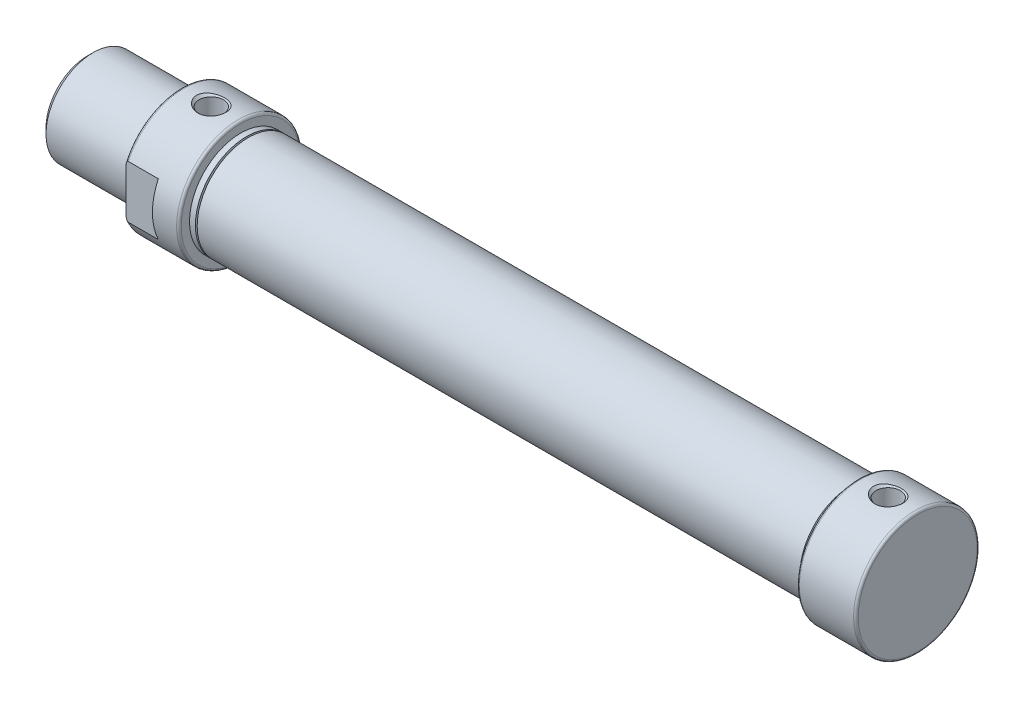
ISO-10303-21;
HEADER;
FILE_DESCRIPTION(('STEP AP214'),'2;1');
FILE_NAME('part.step','',(''),(''),'','','');
FILE_SCHEMA(('AUTOMOTIVE_DESIGN { 1 0 10303 214 1 1 1 1 }'));
ENDSEC;
DATA;
#1=APPLICATION_CONTEXT('core data for automotive mechanical design processes');
#2=APPLICATION_PROTOCOL_DEFINITION('international standard','automotive_design',2000,#1);
#3=PRODUCT_CONTEXT('',#1,'mechanical');
#4=PRODUCT('Part','Part','',(#3));
#5=PRODUCT_RELATED_PRODUCT_CATEGORY('part','',(#4));
#6=PRODUCT_DEFINITION_FORMATION('','',#4);
#7=PRODUCT_DEFINITION_CONTEXT('part definition',#1,'design');
#8=PRODUCT_DEFINITION('design','',#6,#7);
#9=PRODUCT_DEFINITION_SHAPE('','',#8);
#10=(LENGTH_UNIT() NAMED_UNIT(*) SI_UNIT(.MILLI.,.METRE.));
#11=(NAMED_UNIT(*) PLANE_ANGLE_UNIT() SI_UNIT($,.RADIAN.));
#12=(NAMED_UNIT(*) SI_UNIT($,.STERADIAN.) SOLID_ANGLE_UNIT());
#13=UNCERTAINTY_MEASURE_WITH_UNIT(LENGTH_MEASURE(1.E-05),#10,'distance_accuracy_value','');
#14=(GEOMETRIC_REPRESENTATION_CONTEXT(3) GLOBAL_UNCERTAINTY_ASSIGNED_CONTEXT((#13)) GLOBAL_UNIT_ASSIGNED_CONTEXT((#10,
#11,#12)) REPRESENTATION_CONTEXT('',''));
#15=CARTESIAN_POINT('',(0.,0.,0.));
#16=DIRECTION('',(0.,0.,1.));
#17=DIRECTION('',(1.,0.,0.));
#18=AXIS2_PLACEMENT_3D('',#15,#16,#17);
#19=CARTESIAN_POINT('',(141.,0.,0.));
#20=DIRECTION('',(-1.,0.,0.));
#21=DIRECTION('',(0.,0.,1.));
#22=AXIS2_PLACEMENT_3D('',#19,#20,#21);
#23=CYLINDRICAL_SURFACE('',#22,10.5);
#24=CARTESIAN_POINT('',(140.6,0.,0.));
#25=DIRECTION('',(-1.,0.,0.));
#26=DIRECTION('',(0.,0.,1.));
#27=AXIS2_PLACEMENT_3D('',#24,#25,#26);
#28=CIRCLE('',#27,10.5);
#29=CARTESIAN_POINT('',(140.6,0.,10.5));
#30=VERTEX_POINT('',#29);
#31=EDGE_CURVE('E184',#30,#30,#28,.T.);
#32=ORIENTED_EDGE('',*,*,#31,.T.);
#33=EDGE_LOOP('',(#32));
#34=FACE_BOUND('',#33,.T.);
#35=CARTESIAN_POINT('',(131.4,0.,0.));
#36=DIRECTION('',(-1.,0.,0.));
#37=DIRECTION('',(0.,0.,1.));
#38=AXIS2_PLACEMENT_3D('',#35,#36,#37);
#39=CIRCLE('',#38,10.5);
#40=CARTESIAN_POINT('',(131.4,0.,10.5));
#41=VERTEX_POINT('',#40);
#42=EDGE_CURVE('E187',#41,#41,#39,.T.);
#43=ORIENTED_EDGE('',*,*,#42,.F.);
#44=EDGE_LOOP('',(#43));
#45=FACE_BOUND('',#44,.T.);
#46=CARTESIAN_POINT('',(134.309460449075,10.3681992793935,-1.6584462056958));
#47=CARTESIAN_POINT('',(134.219654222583,10.3801184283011,-1.58392560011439));
#48=CARTESIAN_POINT('',(134.135225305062,10.3922449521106,-1.50297447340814));
#49=CARTESIAN_POINT('',(133.9793399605,10.4158892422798,-1.32925986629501));
#50=CARTESIAN_POINT('',(133.907885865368,10.4274068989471,-1.23649426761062));
#51=CARTESIAN_POINT('',(133.771957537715,10.4501643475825,-1.02783283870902));
#52=CARTESIAN_POINT('',(133.709623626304,10.4611701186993,-0.910498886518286));
#53=CARTESIAN_POINT('',(133.607892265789,10.4795728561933,-0.665979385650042));
#54=CARTESIAN_POINT('',(133.568484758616,10.4869714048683,-0.538798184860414));
#55=CARTESIAN_POINT('',(133.517751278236,10.496577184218,-0.292383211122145));
#56=CARTESIAN_POINT('',(133.503959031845,10.499239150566,-0.173672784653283));
#57=CARTESIAN_POINT('',(133.497521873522,10.5004760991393,0.0643135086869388));
#58=CARTESIAN_POINT('',(133.504867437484,10.4990529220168,0.183589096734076));
#59=CARTESIAN_POINT('',(133.539209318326,10.4925053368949,0.411832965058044));
#60=CARTESIAN_POINT('',(133.56500706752,10.4876068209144,0.520991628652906));
#61=CARTESIAN_POINT('',(133.633705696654,10.4748844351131,0.733584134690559));
#62=CARTESIAN_POINT('',(133.676608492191,10.4670602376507,0.837017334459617));
#63=CARTESIAN_POINT('',(133.779538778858,10.448949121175,1.0392996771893));
#64=CARTESIAN_POINT('',(133.840110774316,10.4385859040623,1.13786359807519));
#65=CARTESIAN_POINT('',(133.975489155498,10.4165532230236,1.32448731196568));
#66=CARTESIAN_POINT('',(134.050300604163,10.4048832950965,1.41254335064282));
#67=CARTESIAN_POINT('',(134.219809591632,10.3801083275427,1.58482061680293));
#68=CARTESIAN_POINT('',(134.315735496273,10.3669744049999,1.66782829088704));
#69=CARTESIAN_POINT('',(134.519174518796,10.3416406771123,1.81832451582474));
#70=CARTESIAN_POINT('',(134.626692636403,10.3294412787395,1.88580633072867));
#71=CARTESIAN_POINT('',(134.8619720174,10.305959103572,2.01038307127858));
#72=CARTESIAN_POINT('',(134.990680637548,10.2948942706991,2.06573401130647));
#73=CARTESIAN_POINT('',(135.255393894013,10.2764273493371,2.15572625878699));
#74=CARTESIAN_POINT('',(135.391400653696,10.2690263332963,2.1903615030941));
#75=CARTESIAN_POINT('',(135.675528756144,10.2583548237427,2.23983343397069));
#76=CARTESIAN_POINT('',(135.823888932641,10.2553568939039,2.25336664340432));
#77=CARTESIAN_POINT('',(136.120871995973,10.2547000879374,2.25635204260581));
#78=CARTESIAN_POINT('',(136.269494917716,10.2570419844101,2.24580074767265));
#79=CARTESIAN_POINT('',(136.565340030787,10.2668740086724,2.20041926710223));
#80=CARTESIAN_POINT('',(136.712498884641,10.2744482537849,2.16519225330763));
#81=CARTESIAN_POINT('',(136.998597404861,10.2939217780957,2.07062575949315));
#82=CARTESIAN_POINT('',(137.137536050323,10.3058215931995,2.01128329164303));
#83=CARTESIAN_POINT('',(137.401127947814,10.3323114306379,1.87040017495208));
#84=CARTESIAN_POINT('',(137.525940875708,10.3468651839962,1.78915247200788));
#85=CARTESIAN_POINT('',(137.75890099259,10.3769350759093,1.60556442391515));
#86=CARTESIAN_POINT('',(137.86705225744,10.3924509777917,1.50322925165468));
#87=CARTESIAN_POINT('',(138.056038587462,10.421420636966,1.28653750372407));
#88=CARTESIAN_POINT('',(138.138139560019,10.4349424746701,1.17329858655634));
#89=CARTESIAN_POINT('',(138.279477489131,10.4591519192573,0.933077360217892));
#90=CARTESIAN_POINT('',(138.338737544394,10.4698423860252,0.806109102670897));
#91=CARTESIAN_POINT('',(138.425737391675,10.4858551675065,0.557325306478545));
#92=CARTESIAN_POINT('',(138.456251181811,10.4916425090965,0.436508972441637));
#93=CARTESIAN_POINT('',(138.494727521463,10.4989731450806,0.191228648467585));
#94=CARTESIAN_POINT('',(138.502704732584,10.5005191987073,0.0667670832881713));
#95=CARTESIAN_POINT('',(138.495979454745,10.4992277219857,-0.17041799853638));
#96=CARTESIAN_POINT('',(138.483224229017,10.496766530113,-0.283204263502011));
#97=CARTESIAN_POINT('',(138.439278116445,10.4884371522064,-0.504974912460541));
#98=CARTESIAN_POINT('',(138.408087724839,10.4825690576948,-0.613959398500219));
#99=CARTESIAN_POINT('',(138.328633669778,10.4680396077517,-0.825483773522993));
#100=CARTESIAN_POINT('',(138.280340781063,10.4593734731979,-0.928012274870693));
#101=CARTESIAN_POINT('',(138.16861442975,10.4401071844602,-1.12423241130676));
#102=CARTESIAN_POINT('',(138.105176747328,10.4295064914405,-1.21792157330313));
#103=CARTESIAN_POINT('',(137.959536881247,10.406417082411,-1.40206763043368));
#104=CARTESIAN_POINT('',(137.87622492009,10.3938448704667,-1.491634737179));
#105=CARTESIAN_POINT('',(137.696986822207,10.3687536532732,-1.6570955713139));
#106=CARTESIAN_POINT('',(137.601055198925,10.3562346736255,-1.73298331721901));
#107=CARTESIAN_POINT('',(137.388304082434,10.3310850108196,-1.8773992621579));
#108=CARTESIAN_POINT('',(137.270348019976,10.3185849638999,-1.94427796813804));
#109=CARTESIAN_POINT('',(137.025317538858,10.2962888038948,-2.05909305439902));
#110=CARTESIAN_POINT('',(136.898239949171,10.2864936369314,-2.10702280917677));
#111=CARTESIAN_POINT('',(136.62806319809,10.2699689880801,-2.18621099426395));
#112=CARTESIAN_POINT('',(136.484483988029,10.2635338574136,-2.21590041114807));
#113=CARTESIAN_POINT('',(136.194284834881,10.2556659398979,-2.25203420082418));
#114=CARTESIAN_POINT('',(136.047664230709,10.2542342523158,-2.25847346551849));
#115=CARTESIAN_POINT('',(135.750960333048,10.2565717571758,-2.24783735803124));
#116=CARTESIAN_POINT('',(135.6009028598,10.260496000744,-2.230060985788));
#117=CARTESIAN_POINT('',(135.305964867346,10.2733569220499,-2.17003948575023));
#118=CARTESIAN_POINT('',(135.161084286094,10.2822935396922,-2.12779465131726));
#119=CARTESIAN_POINT('',(134.89205577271,10.3032168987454,-2.02392589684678));
#120=CARTESIAN_POINT('',(134.767176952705,10.314901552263,-1.96412782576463));
#121=CARTESIAN_POINT('',(134.528863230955,10.3403621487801,-1.82534198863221));
#122=CARTESIAN_POINT('',(134.415419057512,10.3541363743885,-1.74636994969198));
#123=CARTESIAN_POINT('',(134.309460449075,10.3681992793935,-1.6584462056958));
#124=B_SPLINE_CURVE_WITH_KNOTS('',3,(#46,#47,#48,#49,#50,#51,#52,#53,#54,#55,#56,#57,#58,#59,
#60,#61,#62,#63,#64,#65,#66,#67,#68,#69,#70,#71,#72,#73,#74,#75,#76,#77,#78,#79,#80,#81,#82,#83,
#84,#85,#86,#87,#88,#89,#90,#91,#92,#93,#94,#95,#96,#97,#98,#99,#100,#101,#102,#103,#104,#105,
#106,#107,#108,#109,#110,#111,#112,#113,#114,#115,#116,#117,#118,#119,#120,#121,#122,#123),
.UNSPECIFIED.,.T.,.F.,(4,2,2,2,2,2,2,2,2,2,2,2,2,2,2,2,2,2,2,2,2,2,2,2,2,2,2,2,2,2,2,2,2,2,2,2,
2,2,4),(0.,0.351562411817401,0.703187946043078,1.10087280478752,1.49838306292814,
1.85510993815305,2.21167610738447,2.54696852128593,2.88229849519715,3.22931033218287,
3.57644578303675,3.95746949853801,4.33865821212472,4.75845050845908,5.17836561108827,
5.62331560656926,6.06832998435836,6.52067034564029,6.97306676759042,7.41968994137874,
7.86620368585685,8.2854151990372,8.70420164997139,9.07637972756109,9.44831562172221,
9.78728990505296,10.1262550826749,10.4658023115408,10.8054442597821,11.17284131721,
11.5403986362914,11.9471783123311,12.3541000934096,12.7923742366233,13.2307446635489,
13.6820784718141,14.1334068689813,14.5485400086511,14.9633337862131),.UNSPECIFIED.);
#125=CARTESIAN_POINT('',(134.309460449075,10.3681992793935,-1.6584462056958));
#126=VERTEX_POINT('',#125);
#127=EDGE_CURVE('E11',#126,#126,#124,.T.);
#128=ORIENTED_EDGE('',*,*,#127,.F.);
#129=EDGE_LOOP('',(#128));
#130=FACE_BOUND('',#129,.T.);
#131=ADVANCED_FACE('F16',(#34,#45,#130),#23,.T.);
#132=CARTESIAN_POINT('',(141.,0.,0.));
#133=DIRECTION('',(-1.,0.,0.));
#134=DIRECTION('',(0.,0.,1.));
#135=AXIS2_PLACEMENT_3D('',#132,#133,#134);
#136=CYLINDRICAL_SURFACE('',#135,10.5);
#137=CARTESIAN_POINT('',(25.6,0.,0.));
#138=DIRECTION('',(-1.,0.,0.));
#139=DIRECTION('',(0.,0.,1.));
#140=AXIS2_PLACEMENT_3D('',#137,#138,#139);
#141=CIRCLE('',#140,10.5);
#142=CARTESIAN_POINT('',(25.6,0.,10.5));
#143=VERTEX_POINT('',#142);
#144=EDGE_CURVE('E219',#143,#143,#141,.T.);
#145=ORIENTED_EDGE('',*,*,#144,.T.);
#146=EDGE_LOOP('',(#145));
#147=FACE_BOUND('',#146,.T.);
#148=DIRECTION('',(-1.,0.,0.));
#149=VECTOR('',#148,1.);
#150=CARTESIAN_POINT('',(141.,-4.47213595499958,9.5));
#151=LINE('',#150,#149);
#152=CARTESIAN_POINT('',(21.5,-4.47213595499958,9.5));
#153=VERTEX_POINT('',#152);
#154=CARTESIAN_POINT('',(16.4,-4.47213595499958,9.5));
#155=VERTEX_POINT('',#154);
#156=EDGE_CURVE('E125',#153,#155,#151,.T.);
#157=ORIENTED_EDGE('',*,*,#156,.T.);
#158=CARTESIAN_POINT('',(16.4,0.,0.));
#159=DIRECTION('',(-1.,0.,0.));
#160=DIRECTION('',(0.,0.,1.));
#161=AXIS2_PLACEMENT_3D('',#158,#159,#160);
#162=CIRCLE('',#161,10.5);
#163=CARTESIAN_POINT('',(16.4,-4.47213595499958,-9.5));
#164=VERTEX_POINT('',#163);
#165=EDGE_CURVE('E102',#164,#155,#162,.T.);
#166=ORIENTED_EDGE('',*,*,#165,.F.);
#167=DIRECTION('',(-1.,0.,0.));
#168=VECTOR('',#167,1.);
#169=CARTESIAN_POINT('',(141.,-4.47213595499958,-9.5));
#170=LINE('',#169,#168);
#171=CARTESIAN_POINT('',(21.5,-4.47213595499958,-9.5));
#172=VERTEX_POINT('',#171);
#173=EDGE_CURVE('E79',#164,#172,#170,.F.);
#174=ORIENTED_EDGE('',*,*,#173,.T.);
#175=CARTESIAN_POINT('',(21.5,0.,0.));
#176=DIRECTION('',(1.,0.,0.));
#177=DIRECTION('',(0.,0.,-1.));
#178=AXIS2_PLACEMENT_3D('',#175,#176,#177);
#179=CIRCLE('',#178,10.5);
#180=CARTESIAN_POINT('',(21.5,4.47213595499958,-9.5));
#181=VERTEX_POINT('',#180);
#182=EDGE_CURVE('E115',#172,#181,#179,.T.);
#183=ORIENTED_EDGE('',*,*,#182,.T.);
#184=DIRECTION('',(-1.,0.,0.));
#185=VECTOR('',#184,1.);
#186=CARTESIAN_POINT('',(141.,4.47213595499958,-9.5));
#187=LINE('',#186,#185);
#188=CARTESIAN_POINT('',(16.4,4.47213595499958,-9.5));
#189=VERTEX_POINT('',#188);
#190=EDGE_CURVE('E118',#181,#189,#187,.T.);
#191=ORIENTED_EDGE('',*,*,#190,.T.);
#192=CARTESIAN_POINT('',(16.4,4.47213595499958,9.5));
#193=VERTEX_POINT('',#192);
#194=EDGE_CURVE('E99',#193,#189,#162,.T.);
#195=ORIENTED_EDGE('',*,*,#194,.F.);
#196=DIRECTION('',(-1.,0.,0.));
#197=VECTOR('',#196,1.);
#198=CARTESIAN_POINT('',(141.,4.47213595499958,9.5));
#199=LINE('',#198,#197);
#200=CARTESIAN_POINT('',(21.5,4.47213595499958,9.5));
#201=VERTEX_POINT('',#200);
#202=EDGE_CURVE('E122',#193,#201,#199,.F.);
#203=ORIENTED_EDGE('',*,*,#202,.T.);
#204=EDGE_CURVE('E119',#201,#153,#179,.T.);
#205=ORIENTED_EDGE('',*,*,#204,.T.);
#206=EDGE_LOOP('',(#157,#166,#174,#183,#191,#195,#203,#205));
#207=FACE_BOUND('',#206,.T.);
#208=CARTESIAN_POINT('',(19.3094604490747,10.3681992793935,-1.65844620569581));
#209=CARTESIAN_POINT('',(19.2196542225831,10.3801184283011,-1.58392560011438));
#210=CARTESIAN_POINT('',(19.1352253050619,10.3922449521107,-1.50297447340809));
#211=CARTESIAN_POINT('',(18.9793399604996,10.4158892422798,-1.32925986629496));
#212=CARTESIAN_POINT('',(18.907885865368,10.4274068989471,-1.23649426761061));
#213=CARTESIAN_POINT('',(18.7719575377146,10.4501643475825,-1.02783283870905));
#214=CARTESIAN_POINT('',(18.7096236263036,10.4611701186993,-0.910498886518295));
#215=CARTESIAN_POINT('',(18.6078922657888,10.4795728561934,-0.665979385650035));
#216=CARTESIAN_POINT('',(18.5684847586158,10.4869714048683,-0.538798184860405));
#217=CARTESIAN_POINT('',(18.5177512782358,10.496577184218,-0.292383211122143));
#218=CARTESIAN_POINT('',(18.5039590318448,10.499239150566,-0.173672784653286));
#219=CARTESIAN_POINT('',(18.4975218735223,10.5004760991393,0.0643135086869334));
#220=CARTESIAN_POINT('',(18.504867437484,10.4990529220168,0.183589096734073));
#221=CARTESIAN_POINT('',(18.5392093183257,10.4925053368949,0.411832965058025));
#222=CARTESIAN_POINT('',(18.5650070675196,10.4876068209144,0.52099162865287));
#223=CARTESIAN_POINT('',(18.6337056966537,10.4748844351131,0.733584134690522));
#224=CARTESIAN_POINT('',(18.6766084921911,10.4670602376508,0.837017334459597));
#225=CARTESIAN_POINT('',(18.7795387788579,10.448949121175,1.0392996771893));
#226=CARTESIAN_POINT('',(18.8401107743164,10.4385859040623,1.1378635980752));
#227=CARTESIAN_POINT('',(18.975489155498,10.4165532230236,1.32448731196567));
#228=CARTESIAN_POINT('',(19.0503006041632,10.4048832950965,1.41254335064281));
#229=CARTESIAN_POINT('',(19.2198095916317,10.3801083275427,1.58482061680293));
#230=CARTESIAN_POINT('',(19.315735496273,10.3669744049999,1.66782829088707));
#231=CARTESIAN_POINT('',(19.5191745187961,10.3416406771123,1.81832451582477));
#232=CARTESIAN_POINT('',(19.6266926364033,10.3294412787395,1.88580633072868));
#233=CARTESIAN_POINT('',(19.8619720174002,10.305959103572,2.01038307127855));
#234=CARTESIAN_POINT('',(19.9906806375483,10.2948942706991,2.06573401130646));
#235=CARTESIAN_POINT('',(20.2553938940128,10.2764273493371,2.15572625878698));
#236=CARTESIAN_POINT('',(20.3914006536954,10.2690263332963,2.1903615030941));
#237=CARTESIAN_POINT('',(20.6755287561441,10.2583548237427,2.23983343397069));
#238=CARTESIAN_POINT('',(20.8238889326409,10.2553568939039,2.25336664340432));
#239=CARTESIAN_POINT('',(21.1208719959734,10.2547000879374,2.25635204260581));
#240=CARTESIAN_POINT('',(21.2694949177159,10.2570419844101,2.24580074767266));
#241=CARTESIAN_POINT('',(21.5653400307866,10.2668740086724,2.20041926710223));
#242=CARTESIAN_POINT('',(21.7124988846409,10.2744482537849,2.16519225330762));
#243=CARTESIAN_POINT('',(21.9985974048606,10.2939217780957,2.07062575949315));
#244=CARTESIAN_POINT('',(22.137536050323,10.3058215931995,2.01128329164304));
#245=CARTESIAN_POINT('',(22.4011279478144,10.3323114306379,1.87040017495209));
#246=CARTESIAN_POINT('',(22.5259408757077,10.3468651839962,1.78915247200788));
#247=CARTESIAN_POINT('',(22.7589009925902,10.3769350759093,1.60556442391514));
#248=CARTESIAN_POINT('',(22.8670522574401,10.3924509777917,1.50322925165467));
#249=CARTESIAN_POINT('',(23.0560385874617,10.421420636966,1.28653750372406));
#250=CARTESIAN_POINT('',(23.1381395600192,10.4349424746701,1.17329858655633));
#251=CARTESIAN_POINT('',(23.2794774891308,10.4591519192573,0.9330773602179));
#252=CARTESIAN_POINT('',(23.3387375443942,10.4698423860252,0.806109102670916));
#253=CARTESIAN_POINT('',(23.4257373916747,10.4858551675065,0.557325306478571));
#254=CARTESIAN_POINT('',(23.456251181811,10.4916425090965,0.436508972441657));
#255=CARTESIAN_POINT('',(23.494727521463,10.4989731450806,0.191228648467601));
#256=CARTESIAN_POINT('',(23.5027047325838,10.5005191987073,0.0667670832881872));
#257=CARTESIAN_POINT('',(23.4959794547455,10.4992277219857,-0.170417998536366));
#258=CARTESIAN_POINT('',(23.4832242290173,10.496766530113,-0.283204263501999));
#259=CARTESIAN_POINT('',(23.4392781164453,10.4884371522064,-0.504974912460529));
#260=CARTESIAN_POINT('',(23.4080877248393,10.4825690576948,-0.613959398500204));
#261=CARTESIAN_POINT('',(23.3286336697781,10.4680396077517,-0.825483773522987));
#262=CARTESIAN_POINT('',(23.2803407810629,10.4593734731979,-0.928012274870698));
#263=CARTESIAN_POINT('',(23.16861442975,10.4401071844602,-1.12423241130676));
#264=CARTESIAN_POINT('',(23.1051767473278,10.4295064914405,-1.21792157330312));
#265=CARTESIAN_POINT('',(22.9595368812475,10.406417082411,-1.40206763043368));
#266=CARTESIAN_POINT('',(22.8762249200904,10.3938448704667,-1.49163473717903));
#267=CARTESIAN_POINT('',(22.6969868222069,10.3687536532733,-1.65709557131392));
#268=CARTESIAN_POINT('',(22.6010551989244,10.3562346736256,-1.73298331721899));
#269=CARTESIAN_POINT('',(22.3883040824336,10.3310850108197,-1.87739926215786));
#270=CARTESIAN_POINT('',(22.2703480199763,10.3185849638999,-1.94427796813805));
#271=CARTESIAN_POINT('',(22.0253175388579,10.2962888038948,-2.05909305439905));
#272=CARTESIAN_POINT('',(21.8982399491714,10.2864936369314,-2.10702280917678));
#273=CARTESIAN_POINT('',(21.6280631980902,10.2699689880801,-2.18621099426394));
#274=CARTESIAN_POINT('',(21.4844839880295,10.2635338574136,-2.21590041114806));
#275=CARTESIAN_POINT('',(21.1942848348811,10.2556659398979,-2.25203420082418));
#276=CARTESIAN_POINT('',(21.0476642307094,10.2542342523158,-2.25847346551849));
#277=CARTESIAN_POINT('',(20.7509603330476,10.2565717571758,-2.24783735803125));
#278=CARTESIAN_POINT('',(20.6009028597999,10.260496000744,-2.23006098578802));
#279=CARTESIAN_POINT('',(20.3059648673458,10.2733569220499,-2.17003948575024));
#280=CARTESIAN_POINT('',(20.1610842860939,10.2822935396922,-2.12779465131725));
#281=CARTESIAN_POINT('',(19.8920557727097,10.3032168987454,-2.02392589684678));
#282=CARTESIAN_POINT('',(19.7671769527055,10.314901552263,-1.96412782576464));
#283=CARTESIAN_POINT('',(19.5288632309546,10.3403621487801,-1.82534198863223));
#284=CARTESIAN_POINT('',(19.4154190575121,10.3541363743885,-1.74636994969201));
#285=CARTESIAN_POINT('',(19.3094604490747,10.3681992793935,-1.65844620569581));
#286=B_SPLINE_CURVE_WITH_KNOTS('',3,(#208,#209,#210,#211,#212,#213,#214,#215,#216,#217,#218,
#219,#220,#221,#222,#223,#224,#225,#226,#227,#228,#229,#230,#231,#232,#233,#234,#235,#236,#237,
#238,#239,#240,#241,#242,#243,#244,#245,#246,#247,#248,#249,#250,#251,#252,#253,#254,#255,#256,
#257,#258,#259,#260,#261,#262,#263,#264,#265,#266,#267,#268,#269,#270,#271,#272,#273,#274,#275,
#276,#277,#278,#279,#280,#281,#282,#283,#284,#285),.UNSPECIFIED.,.T.,.F.,(4,2,2,2,2,2,2,2,2,2,2,
2,2,2,2,2,2,2,2,2,2,2,2,2,2,2,2,2,2,2,2,2,2,2,2,2,2,2,4),(0.,0.351562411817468,
0.703187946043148,1.10087280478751,1.49838306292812,1.85510993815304,2.21167610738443,
2.5469685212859,2.88229849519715,3.22931033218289,3.57644578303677,3.95746949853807,
4.33865821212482,4.75845050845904,5.17836561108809,5.62331560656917,6.06832998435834,
6.5206703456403,6.97306676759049,7.41968994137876,7.86620368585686,8.28541519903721,
8.70420164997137,9.07637972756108,9.44831562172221,9.78728990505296,10.1262550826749,
10.4658023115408,10.8054442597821,11.17284131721,11.5403986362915,11.9471783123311,
12.3541000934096,12.7923742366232,13.2307446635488,13.6820784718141,14.1334068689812,
14.5485400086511,14.9633337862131),.UNSPECIFIED.);
#287=CARTESIAN_POINT('',(19.3094604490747,10.3681992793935,-1.65844620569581));
#288=VERTEX_POINT('',#287);
#289=EDGE_CURVE('E29',#288,#288,#286,.T.);
#290=ORIENTED_EDGE('',*,*,#289,.F.);
#291=EDGE_LOOP('',(#290));
#292=FACE_BOUND('',#291,.T.);
#293=ADVANCED_FACE('F133',(#147,#207,#292),#136,.T.);
#294=CARTESIAN_POINT('',(16.4,0.,0.));
#295=DIRECTION('',(-1.,0.,0.));
#296=DIRECTION('',(0.,0.,1.));
#297=AXIS2_PLACEMENT_3D('',#294,#295,#296);
#298=TOROIDAL_SURFACE('',#297,10.1,0.4);
#299=ORIENTED_EDGE('',*,*,#165,.T.);
#300=CARTESIAN_POINT('',(16.4021928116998,-4.47212184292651,9.5));
#301=CARTESIAN_POINT('',(16.3918519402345,-4.47225336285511,9.5));
#302=CARTESIAN_POINT('',(16.3814872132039,-4.47143578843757,9.5));
#303=CARTESIAN_POINT('',(16.3610600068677,-4.46798509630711,9.5));
#304=CARTESIAN_POINT('',(16.3509981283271,-4.46534859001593,9.5));
#305=CARTESIAN_POINT('',(16.3292591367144,-4.45775040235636,9.5));
#306=CARTESIAN_POINT('',(16.3177181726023,-4.45240293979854,9.5));
#307=CARTESIAN_POINT('',(16.2956553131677,-4.43992098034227,9.5));
#308=CARTESIAN_POINT('',(16.2851352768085,-4.43278330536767,9.5));
#309=CARTESIAN_POINT('',(16.2593117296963,-4.41268921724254,9.5));
#310=CARTESIAN_POINT('',(16.244773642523,-4.39875934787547,9.5));
#311=CARTESIAN_POINT('',(16.2178971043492,-4.36893563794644,9.5));
#312=CARTESIAN_POINT('',(16.2055645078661,-4.35303675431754,9.5));
#313=CARTESIAN_POINT('',(16.1828688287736,-4.32022741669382,9.5));
#314=CARTESIAN_POINT('',(16.1724813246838,-4.3033335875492,9.5));
#315=CARTESIAN_POINT('',(16.1531563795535,-4.26872833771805,9.5));
#316=CARTESIAN_POINT('',(16.1442203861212,-4.25101612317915,9.5));
#317=CARTESIAN_POINT('',(16.1192017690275,-4.19699001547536,9.5));
#318=CARTESIAN_POINT('',(16.1049407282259,-4.15983722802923,9.5));
#319=CARTESIAN_POINT('',(16.0746568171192,-4.06835744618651,9.5));
#320=CARTESIAN_POINT('',(16.0604661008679,-4.01344913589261,9.5));
#321=CARTESIAN_POINT('',(16.0372054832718,-3.90250621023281,9.5));
#322=CARTESIAN_POINT('',(16.0281458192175,-3.84646957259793,9.5));
#323=CARTESIAN_POINT('',(16.0140110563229,-3.73369807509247,9.5));
#324=CARTESIAN_POINT('',(16.0089512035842,-3.67696137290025,9.5));
#325=CARTESIAN_POINT('',(16.0021415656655,-3.56328407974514,9.5));
#326=CARTESIAN_POINT('',(16.0003929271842,-3.50634342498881,9.5));
#327=CARTESIAN_POINT('',(15.9995720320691,-3.36652251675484,9.5));
#328=CARTESIAN_POINT('',(16.0020804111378,-3.2836331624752,9.5));
#329=CARTESIAN_POINT('',(16.0122035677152,-3.11811965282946,9.5));
#330=CARTESIAN_POINT('',(16.0198223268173,-3.03549575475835,9.5));
#331=CARTESIAN_POINT('',(16.0398120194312,-2.87105530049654,9.5));
#332=CARTESIAN_POINT('',(16.0521701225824,-2.78923717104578,9.5));
#333=CARTESIAN_POINT('',(16.0818253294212,-2.62653841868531,9.5));
#334=CARTESIAN_POINT('',(16.0991182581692,-2.54565706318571,9.5));
#335=CARTESIAN_POINT('',(16.1313160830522,-2.4197573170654,9.5));
#336=CARTESIAN_POINT('',(16.1440813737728,-2.37418934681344,9.5));
#337=CARTESIAN_POINT('',(16.1723590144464,-2.28399216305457,9.5));
#338=CARTESIAN_POINT('',(16.187864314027,-2.23936086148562,9.5));
#339=CARTESIAN_POINT('',(16.2125868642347,-2.1783486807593,9.5));
#340=CARTESIAN_POINT('',(16.2199329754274,-2.16121263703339,9.5));
#341=CARTESIAN_POINT('',(16.2355759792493,-2.12730143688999,9.5));
#342=CARTESIAN_POINT('',(16.2438758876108,-2.11052763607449,9.5));
#343=CARTESIAN_POINT('',(16.2620100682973,-2.07718719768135,9.5));
#344=CARTESIAN_POINT('',(16.27188237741,-2.06064126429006,9.5));
#345=CARTESIAN_POINT('',(16.2936246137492,-2.02893226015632,9.5));
#346=CARTESIAN_POINT('',(16.3054814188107,-2.01376105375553,9.5));
#347=CARTESIAN_POINT('',(16.3234726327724,-1.99572605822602,9.5));
#348=CARTESIAN_POINT('',(16.3281325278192,-1.99141561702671,9.5));
#349=CARTESIAN_POINT('',(16.3378995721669,-1.98331038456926,9.5));
#350=CARTESIAN_POINT('',(16.3430072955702,-1.9795162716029,9.5));
#351=CARTESIAN_POINT('',(16.353786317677,-1.97262601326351,9.5));
#352=CARTESIAN_POINT('',(16.3594644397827,-1.9695402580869,9.5));
#353=CARTESIAN_POINT('',(16.3712933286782,-1.96447725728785,9.5));
#354=CARTESIAN_POINT('',(16.3774422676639,-1.9624959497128,9.5));
#355=CARTESIAN_POINT('',(16.388298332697,-1.96030976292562,9.5));
#356=CARTESIAN_POINT('',(16.3929371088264,-1.95976626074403,9.5));
#357=CARTESIAN_POINT('',(16.4022394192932,-1.95948930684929,9.5));
#358=CARTESIAN_POINT('',(16.4069029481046,-1.95975568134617,9.5));
#359=CARTESIAN_POINT('',(16.4161002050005,-1.96106496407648,9.5));
#360=CARTESIAN_POINT('',(16.4206343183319,-1.96210524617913,9.5));
#361=CARTESIAN_POINT('',(16.4294939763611,-1.96485272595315,9.5));
#362=CARTESIAN_POINT('',(16.4338193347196,-1.96656050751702,9.5));
#363=CARTESIAN_POINT('',(16.4448131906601,-1.97173250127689,9.5));
#364=CARTESIAN_POINT('',(16.4512762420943,-1.97562976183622,9.5));
#365=CARTESIAN_POINT('',(16.4635440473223,-1.98434964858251,9.5));
#366=CARTESIAN_POINT('',(16.469346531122,-1.98917532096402,9.5));
#367=CARTESIAN_POINT('',(16.4886306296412,-2.00703491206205,9.5));
#368=CARTESIAN_POINT('',(16.5006744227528,-2.02158716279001,9.5));
#369=CARTESIAN_POINT('',(16.5226956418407,-2.0521697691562,9.5));
#370=CARTESIAN_POINT('',(16.5326593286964,-2.06820900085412,9.5));
#371=CARTESIAN_POINT('',(16.5586035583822,-2.1141080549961,9.5));
#372=CARTESIAN_POINT('',(16.5730708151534,-2.1448187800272,9.5));
#373=CARTESIAN_POINT('',(16.5995426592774,-2.20730144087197,9.5));
#374=CARTESIAN_POINT('',(16.611540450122,-2.23907603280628,9.5));
#375=CARTESIAN_POINT('',(16.6338431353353,-2.3033470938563,9.5));
#376=CARTESIAN_POINT('',(16.6441416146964,-2.33584579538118,9.5));
#377=CARTESIAN_POINT('',(16.6633951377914,-2.40118303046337,9.5));
#378=CARTESIAN_POINT('',(16.6723519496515,-2.4340210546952,9.5));
#379=CARTESIAN_POINT('',(16.694502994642,-2.52085018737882,9.5));
#380=CARTESIAN_POINT('',(16.7067906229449,-2.57507337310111,9.5));
#381=CARTESIAN_POINT('',(16.7289786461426,-2.68401117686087,9.5));
#382=CARTESIAN_POINT('',(16.7388783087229,-2.73872594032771,9.5));
#383=CARTESIAN_POINT('',(16.7653550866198,-2.90362052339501,9.5));
#384=CARTESIAN_POINT('',(16.7786585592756,-3.01433890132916,9.5));
#385=CARTESIAN_POINT('',(16.7963474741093,-3.23575581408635,9.5));
#386=CARTESIAN_POINT('',(16.8007937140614,-3.34644923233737,9.5));
#387=CARTESIAN_POINT('',(16.7994357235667,-3.51229931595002,9.5));
#388=CARTESIAN_POINT('',(16.7976511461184,-3.56749403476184,9.5));
#389=CARTESIAN_POINT('',(16.7909583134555,-3.67768548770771,9.5));
#390=CARTESIAN_POINT('',(16.7860514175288,-3.73268229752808,9.5));
#391=CARTESIAN_POINT('',(16.7742624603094,-3.82761297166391,9.5));
#392=CARTESIAN_POINT('',(16.7682557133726,-3.8676537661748,9.5));
#393=CARTESIAN_POINT('',(16.7537889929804,-3.94738060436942,9.5));
#394=CARTESIAN_POINT('',(16.7453238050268,-3.98706570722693,9.5));
#395=CARTESIAN_POINT('',(16.7235885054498,-4.07278509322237,9.5));
#396=CARTESIAN_POINT('',(16.7097286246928,-4.11868023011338,9.5));
#397=CARTESIAN_POINT('',(16.6846597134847,-4.18584846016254,9.5));
#398=CARTESIAN_POINT('',(16.6756075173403,-4.2079259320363,9.5));
#399=CARTESIAN_POINT('',(16.6557660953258,-4.25127784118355,9.5));
#400=CARTESIAN_POINT('',(16.6449787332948,-4.2725531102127,9.5));
#401=CARTESIAN_POINT('',(16.6244499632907,-4.30829980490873,9.5));
#402=CARTESIAN_POINT('',(16.6152116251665,-4.32305820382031,9.5));
#403=CARTESIAN_POINT('',(16.5953461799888,-4.35166086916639,9.5));
#404=CARTESIAN_POINT('',(16.584716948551,-4.36550368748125,9.5));
#405=CARTESIAN_POINT('',(16.5616957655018,-4.39193908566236,9.5));
#406=CARTESIAN_POINT('',(16.5492853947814,-4.40451591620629,9.5));
#407=CARTESIAN_POINT('',(16.5225328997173,-4.42743280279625,9.5));
#408=CARTESIAN_POINT('',(16.5081972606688,-4.43778007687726,9.5));
#409=CARTESIAN_POINT('',(16.483537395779,-4.45166818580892,9.5));
#410=CARTESIAN_POINT('',(16.4738251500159,-4.4562904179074,9.5));
#411=CARTESIAN_POINT('',(16.4537887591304,-4.46390358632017,9.5));
#412=CARTESIAN_POINT('',(16.4434663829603,-4.46689900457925,9.5));
#413=CARTESIAN_POINT('',(16.4278981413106,-4.46992524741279,9.5));
#414=CARTESIAN_POINT('',(16.4227878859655,-4.47068809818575,9.5));
#415=CARTESIAN_POINT('',(16.4125180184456,-4.4717536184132,9.5));
#416=CARTESIAN_POINT('',(16.4073583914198,-4.4720561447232,9.5));
#417=CARTESIAN_POINT('',(16.4021928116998,-4.47212184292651,9.5));
#418=B_SPLINE_CURVE_WITH_KNOTS('',3,(#300,#301,#302,#303,#304,#305,#306,#307,#308,#309,#310,
#311,#312,#313,#314,#315,#316,#317,#318,#319,#320,#321,#322,#323,#324,#325,#326,#327,#328,#329,
#330,#331,#332,#333,#334,#335,#336,#337,#338,#339,#340,#341,#342,#343,#344,#345,#346,#347,#348,
#349,#350,#351,#352,#353,#354,#355,#356,#357,#358,#359,#360,#361,#362,#363,#364,#365,#366,#367,
#368,#369,#370,#371,#372,#373,#374,#375,#376,#377,#378,#379,#380,#381,#382,#383,#384,#385,#386,
#387,#388,#389,#390,#391,#392,#393,#394,#395,#396,#397,#398,#399,#400,#401,#402,#403,#404,#405,
#406,#407,#408,#409,#410,#411,#412,#413,#414,#415,#416,#417),.UNSPECIFIED.,.T.,.F.,(4,2,2,2,2,2,
2,2,2,2,2,2,2,2,2,2,2,2,2,2,2,2,2,2,2,2,2,2,2,2,2,2,2,2,2,2,2,2,2,2,2,2,2,2,2,2,2,2,2,2,2,2,2,2,
2,2,2,2,4),(0.,0.0310034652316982,0.0620648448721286,0.100009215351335,0.138021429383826,
0.198085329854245,0.258306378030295,0.317711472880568,0.377175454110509,0.496281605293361,
0.666065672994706,0.836187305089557,1.00695430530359,1.17778043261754,1.42636727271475,
1.67514801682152,1.9232599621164,2.17116261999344,2.31308492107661,2.45464721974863,
2.5105633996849,2.5666615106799,2.6244143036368,2.68179929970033,2.70081550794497,
2.7198564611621,2.73916102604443,2.75839411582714,2.77233974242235,2.7862823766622,
2.80017791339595,2.81408563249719,2.83659548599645,2.85918049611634,2.915411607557,
2.97200313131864,3.07358138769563,3.17543557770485,3.27766588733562,3.37976026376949,
3.54648033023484,3.71325145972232,4.0474454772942,4.37933750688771,4.54494143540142,
4.71047331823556,4.83187530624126,4.95353669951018,5.09703877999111,5.16856889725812,
5.24002268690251,5.29219773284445,5.34445341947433,5.39729471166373,5.44996227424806,
5.48211904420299,5.51418676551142,5.52966912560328,5.54515629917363),.UNSPECIFIED.);
#419=CARTESIAN_POINT('',(16.,-3.42928563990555,9.5));
#420=VERTEX_POINT('',#419);
#421=EDGE_CURVE('E98',#155,#420,#418,.T.);
#422=ORIENTED_EDGE('',*,*,#421,.T.);
#423=CARTESIAN_POINT('',(16.,0.,0.));
#424=DIRECTION('',(-1.,0.,0.));
#425=DIRECTION('',(0.,0.,1.));
#426=AXIS2_PLACEMENT_3D('',#423,#424,#425);
#427=CIRCLE('',#426,10.1);
#428=CARTESIAN_POINT('',(16.,-3.42928563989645,-9.5));
#429=VERTEX_POINT('',#428);
#430=EDGE_CURVE('E90',#429,#420,#427,.T.);
#431=ORIENTED_EDGE('',*,*,#430,.F.);
#432=CARTESIAN_POINT('',(16.4021928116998,-4.47212184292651,-9.5));
#433=CARTESIAN_POINT('',(16.4126908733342,-4.47198512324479,-9.5));
#434=CARTESIAN_POINT('',(16.4231856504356,-4.47086999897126,-9.5));
#435=CARTESIAN_POINT('',(16.4438155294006,-4.46680084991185,-9.5));
#436=CARTESIAN_POINT('',(16.4539499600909,-4.46384356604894,-9.5));
#437=CARTESIAN_POINT('',(16.4759754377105,-4.45547185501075,-9.5));
#438=CARTESIAN_POINT('',(16.4877055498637,-4.44963846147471,-9.5));
#439=CARTESIAN_POINT('',(16.5100738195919,-4.436171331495,-9.5));
#440=CARTESIAN_POINT('',(16.5207098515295,-4.4285341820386,-9.5));
#441=CARTESIAN_POINT('',(16.5470646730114,-4.40691945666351,-9.5));
#442=CARTESIAN_POINT('',(16.5619315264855,-4.39191402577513,-9.5));
#443=CARTESIAN_POINT('',(16.5893247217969,-4.35992066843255,-9.5));
#444=CARTESIAN_POINT('',(16.6018448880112,-4.34292769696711,-9.5));
#445=CARTESIAN_POINT('',(16.6250079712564,-4.30766231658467,-9.5));
#446=CARTESIAN_POINT('',(16.6356459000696,-4.28938668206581,-9.5));
#447=CARTESIAN_POINT('',(16.6553608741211,-4.25200393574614,-9.5));
#448=CARTESIAN_POINT('',(16.6644363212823,-4.23289599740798,-9.5));
#449=CARTESIAN_POINT('',(16.6897501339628,-4.1746666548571,-9.5));
#450=CARTESIAN_POINT('',(16.7040381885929,-4.1347023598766,-9.5));
#451=CARTESIAN_POINT('',(16.7342813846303,-4.03587976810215,-9.5));
#452=CARTESIAN_POINT('',(16.7482142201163,-3.9764297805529,-9.5));
#453=CARTESIAN_POINT('',(16.7705506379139,-3.85644361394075,-9.5));
#454=CARTESIAN_POINT('',(16.7789431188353,-3.79590550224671,-9.5));
#455=CARTESIAN_POINT('',(16.7914121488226,-3.67425465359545,-9.5));
#456=CARTESIAN_POINT('',(16.7954779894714,-3.61314086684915,-9.5));
#457=CARTESIAN_POINT('',(16.8000349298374,-3.49076545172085,-9.5));
#458=CARTESIAN_POINT('',(16.800524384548,-3.42950376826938,-9.5));
#459=CARTESIAN_POINT('',(16.7983513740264,-3.30311410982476,-9.5));
#460=CARTESIAN_POINT('',(16.7954848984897,-3.23798996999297,-9.5));
#461=CARTESIAN_POINT('',(16.7866238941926,-3.10797513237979,-9.5));
#462=CARTESIAN_POINT('',(16.7806300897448,-3.04308438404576,-9.5));
#463=CARTESIAN_POINT('',(16.7656886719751,-2.91370156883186,-9.5));
#464=CARTESIAN_POINT('',(16.7567436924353,-2.84920919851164,-9.5));
#465=CARTESIAN_POINT('',(16.7358478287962,-2.72073848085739,-9.5));
#466=CARTESIAN_POINT('',(16.7238980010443,-2.6567599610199,-9.5));
#467=CARTESIAN_POINT('',(16.6957975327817,-2.52550081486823,-9.5));
#468=CARTESIAN_POINT('',(16.6794305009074,-2.45826462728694,-9.5));
#469=CARTESIAN_POINT('',(16.651060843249,-2.35860209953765,-9.5));
#470=CARTESIAN_POINT('',(16.6409850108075,-2.32562650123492,-9.5));
#471=CARTESIAN_POINT('',(16.6191759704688,-2.26023282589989,-9.5));
#472=CARTESIAN_POINT('',(16.6074438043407,-2.22781441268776,-9.5));
#473=CARTESIAN_POINT('',(16.5875154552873,-2.1785839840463,-9.5));
#474=CARTESIAN_POINT('',(16.5801640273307,-2.16143080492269,-9.5));
#475=CARTESIAN_POINT('',(16.5645118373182,-2.12748389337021,-9.5));
#476=CARTESIAN_POINT('',(16.5562080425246,-2.11069152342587,-9.5));
#477=CARTESIAN_POINT('',(16.5380656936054,-2.07731668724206,-9.5));
#478=CARTESIAN_POINT('',(16.5281892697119,-2.06075482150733,-9.5));
#479=CARTESIAN_POINT('',(16.5064373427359,-2.02901341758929,-9.5));
#480=CARTESIAN_POINT('',(16.4945748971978,-2.01382578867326,-9.5));
#481=CARTESIAN_POINT('',(16.4765751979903,-1.99577136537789,-9.5));
#482=CARTESIAN_POINT('',(16.4719141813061,-1.99145713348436,-9.5));
#483=CARTESIAN_POINT('',(16.4621446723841,-1.98334434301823,-9.5));
#484=CARTESIAN_POINT('',(16.4570356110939,-1.9795464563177,-9.5));
#485=CARTESIAN_POINT('',(16.4462534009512,-1.97264863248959,-9.5));
#486=CARTESIAN_POINT('',(16.4405734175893,-1.96955909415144,-9.5));
#487=CARTESIAN_POINT('',(16.4287400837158,-1.96448897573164,-9.5));
#488=CARTESIAN_POINT('',(16.4225885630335,-1.96250433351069,-9.5));
#489=CARTESIAN_POINT('',(16.4117298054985,-1.96031385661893,-9.5));
#490=CARTESIAN_POINT('',(16.4070911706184,-1.95976873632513,-9.5));
#491=CARTESIAN_POINT('',(16.3977888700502,-1.95948852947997,-9.5));
#492=CARTESIAN_POINT('',(16.3931252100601,-1.95975326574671,-9.5));
#493=CARTESIAN_POINT('',(16.3839273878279,-1.96105945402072,-9.5));
#494=CARTESIAN_POINT('',(16.3793928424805,-1.96209828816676,-9.5));
#495=CARTESIAN_POINT('',(16.3705321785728,-1.96484315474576,-9.5));
#496=CARTESIAN_POINT('',(16.36620624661,-1.96654977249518,-9.5));
#497=CARTESIAN_POINT('',(16.3552139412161,-1.97171763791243,-9.5));
#498=CARTESIAN_POINT('',(16.3487526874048,-1.97561152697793,-9.5));
#499=CARTESIAN_POINT('',(16.3364880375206,-1.9843245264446,-9.5));
#500=CARTESIAN_POINT('',(16.330686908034,-1.98914668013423,-9.5));
#501=CARTESIAN_POINT('',(16.311412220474,-2.00698929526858,-9.5));
#502=CARTESIAN_POINT('',(16.2993745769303,-2.0215267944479,-9.5));
#503=CARTESIAN_POINT('',(16.2773640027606,-2.05207948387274,-9.5));
#504=CARTESIAN_POINT('',(16.2674047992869,-2.06810354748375,-9.5));
#505=CARTESIAN_POINT('',(16.2414765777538,-2.11395168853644,-9.5));
#506=CARTESIAN_POINT('',(16.2270186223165,-2.14462582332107,-9.5));
#507=CARTESIAN_POINT('',(16.2005629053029,-2.20703483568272,-9.5));
#508=CARTESIAN_POINT('',(16.1885719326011,-2.23877236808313,-9.5));
#509=CARTESIAN_POINT('',(16.1662811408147,-2.30296885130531,-9.5));
#510=CARTESIAN_POINT('',(16.1559877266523,-2.33543003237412,-9.5));
#511=CARTESIAN_POINT('',(16.136742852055,-2.40069213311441,-9.5));
#512=CARTESIAN_POINT('',(16.127789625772,-2.43349254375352,-9.5));
#513=CARTESIAN_POINT('',(16.1056338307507,-2.52027089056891,-9.5));
#514=CARTESIAN_POINT('',(16.0933393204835,-2.57448146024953,-9.5));
#515=CARTESIAN_POINT('',(16.0711377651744,-2.68339448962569,-9.5));
#516=CARTESIAN_POINT('',(16.0612314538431,-2.7380970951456,-9.5));
#517=CARTESIAN_POINT('',(16.0347340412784,-2.90295547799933,-9.5));
#518=CARTESIAN_POINT('',(16.0214159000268,-3.01365020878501,-9.5));
#519=CARTESIAN_POINT('',(16.0036919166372,-3.235022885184,-9.5));
#520=CARTESIAN_POINT('',(15.9992254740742,-3.34569572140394,-9.5));
#521=CARTESIAN_POINT('',(16.0005454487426,-3.51151699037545,-9.5));
#522=CARTESIAN_POINT('',(16.0023160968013,-3.56670254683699,-9.5));
#523=CARTESIAN_POINT('',(16.0089774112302,-3.67687678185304,-9.5));
#524=CARTESIAN_POINT('',(16.013866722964,-3.73186553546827,-9.5));
#525=CARTESIAN_POINT('',(16.025613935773,-3.82673083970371,-9.5));
#526=CARTESIAN_POINT('',(16.0315950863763,-3.86671420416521,-9.5));
#527=CARTESIAN_POINT('',(16.0459993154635,-3.94632856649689,-9.5));
#528=CARTESIAN_POINT('',(16.0544275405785,-3.98595863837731,-9.5));
#529=CARTESIAN_POINT('',(16.0760878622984,-4.07165565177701,-9.5));
#530=CARTESIAN_POINT('',(16.0899148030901,-4.11758270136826,-9.5));
#531=CARTESIAN_POINT('',(16.1149264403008,-4.18480729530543,-9.5));
#532=CARTESIAN_POINT('',(16.1239584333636,-4.20690524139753,-9.5));
#533=CARTESIAN_POINT('',(16.1437557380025,-4.25030245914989,-9.5));
#534=CARTESIAN_POINT('',(16.1545192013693,-4.27160255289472,-9.5));
#535=CARTESIAN_POINT('',(16.1749596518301,-4.30732420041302,-9.5));
#536=CARTESIAN_POINT('',(16.1841291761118,-4.32203425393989,-9.5));
#537=CARTESIAN_POINT('',(16.2038382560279,-4.35055620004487,-9.5));
#538=CARTESIAN_POINT('',(16.214379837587,-4.36436671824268,-9.5));
#539=CARTESIAN_POINT('',(16.2371979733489,-4.39076142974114,-9.5));
#540=CARTESIAN_POINT('',(16.2494921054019,-4.40333069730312,-9.5));
#541=CARTESIAN_POINT('',(16.2759854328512,-4.42628712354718,-9.5));
#542=CARTESIAN_POINT('',(16.2901784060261,-4.43668113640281,-9.5));
#543=CARTESIAN_POINT('',(16.3146329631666,-4.45073417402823,-9.5));
#544=CARTESIAN_POINT('',(16.3242883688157,-4.45544257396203,-9.5));
#545=CARTESIAN_POINT('',(16.3442225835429,-4.46325493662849,-9.5));
#546=CARTESIAN_POINT('',(16.3544998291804,-4.46636275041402,-9.5));
#547=CARTESIAN_POINT('',(16.3710834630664,-4.46978987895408,-9.5));
#548=CARTESIAN_POINT('',(16.3772652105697,-4.47073129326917,-9.5));
#549=CARTESIAN_POINT('',(16.3896959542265,-4.47193803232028,-9.5));
#550=CARTESIAN_POINT('',(16.3959449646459,-4.47220321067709,-9.5));
#551=CARTESIAN_POINT('',(16.4021928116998,-4.47212184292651,-9.5));
#552=B_SPLINE_CURVE_WITH_KNOTS('',3,(#432,#433,#434,#435,#436,#437,#438,#439,#440,#441,#442,
#443,#444,#445,#446,#447,#448,#449,#450,#451,#452,#453,#454,#455,#456,#457,#458,#459,#460,#461,
#462,#463,#464,#465,#466,#467,#468,#469,#470,#471,#472,#473,#474,#475,#476,#477,#478,#479,#480,
#481,#482,#483,#484,#485,#486,#487,#488,#489,#490,#491,#492,#493,#494,#495,#496,#497,#498,#499,
#500,#501,#502,#503,#504,#505,#506,#507,#508,#509,#510,#511,#512,#513,#514,#515,#516,#517,#518,
#519,#520,#521,#522,#523,#524,#525,#526,#527,#528,#529,#530,#531,#532,#533,#534,#535,#536,#537,
#538,#539,#540,#541,#542,#543,#544,#545,#546,#547,#548,#549,#550,#551),.UNSPECIFIED.,.T.,.F.,(4,
2,2,2,2,2,2,2,2,2,2,2,2,2,2,2,2,2,2,2,2,2,2,2,2,2,2,2,2,2,2,2,2,2,2,2,2,2,2,2,2,2,2,2,2,2,2,2,2,
2,2,2,2,2,2,2,2,2,2,4),(0.,0.0314705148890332,0.0629968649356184,0.102077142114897,
0.141231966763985,0.204245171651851,0.267421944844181,0.330763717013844,0.394169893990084,
0.521199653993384,0.704001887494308,0.887169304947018,1.0707890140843,1.25449317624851,
1.44997055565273,1.64540268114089,1.84066086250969,2.03585049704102,2.24327697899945,
2.34669289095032,2.4500440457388,2.50601383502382,2.56216708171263,2.61996722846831,
2.67740129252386,2.69642769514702,2.71547862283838,2.73479349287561,2.75403687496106,
2.76798266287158,2.78192539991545,2.79582119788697,2.80972920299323,2.83222927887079,
2.85480441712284,2.91099006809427,2.9675358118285,3.06900317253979,3.17074613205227,
3.27286459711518,3.3748473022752,3.54153494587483,3.70827373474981,4.04240272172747,
4.37423618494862,4.53981143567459,4.70531481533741,4.82653549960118,4.94801300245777,
5.09157956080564,5.1631438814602,5.2346323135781,5.28657636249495,5.33859799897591,
5.39118387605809,5.44360147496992,5.47571891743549,5.50775871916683,5.52648412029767,
5.54521357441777),.UNSPECIFIED.);
#553=EDGE_CURVE('E72',#429,#164,#552,.T.);
#554=ORIENTED_EDGE('',*,*,#553,.T.);
#555=EDGE_LOOP('',(#299,#422,#431,#554));
#556=FACE_BOUND('',#555,.T.);
#557=ADVANCED_FACE('F96',(#556),#298,.T.);
#558=CARTESIAN_POINT('',(0.,0.,0.));
#559=DIRECTION('',(1.,0.,0.));
#560=DIRECTION('',(0.,0.,-1.));
#561=AXIS2_PLACEMENT_3D('',#558,#559,#560);
#562=PLANE('',#561);
#563=CARTESIAN_POINT('',(0.,0.,0.));
#564=DIRECTION('',(-1.,0.,0.));
#565=DIRECTION('',(0.,0.,1.));
#566=AXIS2_PLACEMENT_3D('',#563,#564,#565);
#567=CIRCLE('',#566,3.);
#568=CARTESIAN_POINT('',(0.,0.,3.));
#569=VERTEX_POINT('',#568);
#570=EDGE_CURVE('E249',#569,#569,#567,.T.);
#571=ORIENTED_EDGE('',*,*,#570,.F.);
#572=EDGE_LOOP('',(#571));
#573=FACE_BOUND('',#572,.T.);
#574=CARTESIAN_POINT('',(0.,0.,0.));
#575=DIRECTION('',(-1.,0.,0.));
#576=DIRECTION('',(0.,0.,1.));
#577=AXIS2_PLACEMENT_3D('',#574,#575,#576);
#578=CIRCLE('',#577,7.08);
#579=CARTESIAN_POINT('',(0.,0.,7.08));
#580=VERTEX_POINT('',#579);
#581=EDGE_CURVE('E111',#580,#580,#578,.T.);
#582=ORIENTED_EDGE('',*,*,#581,.T.);
#583=EDGE_LOOP('',(#582));
#584=FACE_BOUND('',#583,.T.);
#585=ADVANCED_FACE('F18',(#573,#584),#562,.F.);
#586=CARTESIAN_POINT('',(0.92,0.,0.));
#587=DIRECTION('',(1.,0.,0.));
#588=DIRECTION('',(0.,0.,-1.));
#589=AXIS2_PLACEMENT_3D('',#586,#587,#588);
#590=CONICAL_SURFACE('',#589,8.,0.785398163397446);
#591=ORIENTED_EDGE('',*,*,#581,.F.);
#592=EDGE_LOOP('',(#591));
#593=FACE_BOUND('',#592,.T.);
#594=CARTESIAN_POINT('',(0.92,0.,0.));
#595=DIRECTION('',(-1.,0.,0.));
#596=DIRECTION('',(0.,0.,1.));
#597=AXIS2_PLACEMENT_3D('',#594,#595,#596);
#598=CIRCLE('',#597,8.);
#599=CARTESIAN_POINT('',(0.92,0.,8.));
#600=VERTEX_POINT('',#599);
#601=EDGE_CURVE('E108',#600,#600,#598,.T.);
#602=ORIENTED_EDGE('',*,*,#601,.T.);
#603=EDGE_LOOP('',(#602));
#604=FACE_BOUND('',#603,.T.);
#605=ADVANCED_FACE('F393',(#593,#604),#590,.T.);
#606=CARTESIAN_POINT('',(141.,0.,0.));
#607=DIRECTION('',(-1.,0.,0.));
#608=DIRECTION('',(0.,0.,1.));
#609=AXIS2_PLACEMENT_3D('',#606,#607,#608);
#610=CYLINDRICAL_SURFACE('',#609,8.);
#611=ORIENTED_EDGE('',*,*,#601,.F.);
#612=EDGE_LOOP('',(#611));
#613=FACE_BOUND('',#612,.T.);
#614=CARTESIAN_POINT('',(16.,0.,0.));
#615=DIRECTION('',(-1.,0.,0.));
#616=DIRECTION('',(0.,0.,1.));
#617=AXIS2_PLACEMENT_3D('',#614,#615,#616);
#618=CIRCLE('',#617,8.);
#619=CARTESIAN_POINT('',(16.,0.,8.));
#620=VERTEX_POINT('',#619);
#621=EDGE_CURVE('E101',#620,#620,#618,.T.);
#622=ORIENTED_EDGE('',*,*,#621,.T.);
#623=EDGE_LOOP('',(#622));
#624=FACE_BOUND('',#623,.T.);
#625=ADVANCED_FACE('F398',(#613,#624),#610,.T.);
#626=CARTESIAN_POINT('',(16.,8.,0.));
#627=DIRECTION('',(1.,0.,0.));
#628=DIRECTION('',(0.,0.,-1.));
#629=AXIS2_PLACEMENT_3D('',#626,#627,#628);
#630=PLANE('',#629);
#631=ORIENTED_EDGE('',*,*,#621,.F.);
#632=EDGE_LOOP('',(#631));
#633=FACE_BOUND('',#632,.T.);
#634=ORIENTED_EDGE('',*,*,#430,.T.);
#635=DIRECTION('',(0.,-1.,0.));
#636=VECTOR('',#635,1.);
#637=CARTESIAN_POINT('',(16.,10.5,9.5));
#638=LINE('',#637,#636);
#639=CARTESIAN_POINT('',(16.,3.4292856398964,9.5));
#640=VERTEX_POINT('',#639);
#641=EDGE_CURVE('E93',#640,#420,#638,.T.);
#642=ORIENTED_EDGE('',*,*,#641,.F.);
#643=CARTESIAN_POINT('',(16.,3.42928563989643,-9.5));
#644=VERTEX_POINT('',#643);
#645=EDGE_CURVE('E92',#640,#644,#427,.T.);
#646=ORIENTED_EDGE('',*,*,#645,.T.);
#647=DIRECTION('',(0.,1.,0.));
#648=VECTOR('',#647,1.);
#649=CARTESIAN_POINT('',(16.,-10.5,-9.5));
#650=LINE('',#649,#648);
#651=EDGE_CURVE('E76',#429,#644,#650,.T.);
#652=ORIENTED_EDGE('',*,*,#651,.F.);
#653=EDGE_LOOP('',(#634,#642,#646,#652));
#654=FACE_BOUND('',#653,.T.);
#655=ADVANCED_FACE('F88',(#633,#654),#630,.F.);
#656=ORIENTED_EDGE('',*,*,#645,.F.);
#657=CARTESIAN_POINT('',(16.4489079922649,1.97439439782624,9.5));
#658=CARTESIAN_POINT('',(16.444010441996,1.9714316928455,9.5));
#659=CARTESIAN_POINT('',(16.4389153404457,1.96878942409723,9.5));
#660=CARTESIAN_POINT('',(16.4283516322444,1.96439378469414,9.5));
#661=CARTESIAN_POINT('',(16.4228837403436,1.96263876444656,9.5));
#662=CARTESIAN_POINT('',(16.4127507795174,1.96047001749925,9.5));
#663=CARTESIAN_POINT('',(16.4081266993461,1.95986688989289,9.5));
#664=CARTESIAN_POINT('',(16.3988435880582,1.95946700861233,9.5));
#665=CARTESIAN_POINT('',(16.3941845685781,1.95966999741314,9.5));
#666=CARTESIAN_POINT('',(16.3849837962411,1.96085615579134,9.5));
#667=CARTESIAN_POINT('',(16.3804417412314,1.96183705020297,9.5));
#668=CARTESIAN_POINT('',(16.3715598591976,1.9644742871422,9.5));
#669=CARTESIAN_POINT('',(16.3672202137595,1.96613122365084,9.5));
#670=CARTESIAN_POINT('',(16.3562972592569,1.97113148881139,9.5));
#671=CARTESIAN_POINT('',(16.3499067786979,1.97489244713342,9.5));
#672=CARTESIAN_POINT('',(16.3377660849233,1.98333411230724,9.5));
#673=CARTESIAN_POINT('',(16.3320180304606,1.98801778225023,9.5));
#674=CARTESIAN_POINT('',(16.313113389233,2.0051955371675,9.5));
#675=CARTESIAN_POINT('',(16.3013183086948,2.01915571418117,9.5));
#676=CARTESIAN_POINT('',(16.2797276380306,2.04853740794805,9.5));
#677=CARTESIAN_POINT('',(16.2699453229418,2.06396770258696,9.5));
#678=CARTESIAN_POINT('',(16.2446465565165,2.10783072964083,9.5));
#679=CARTESIAN_POINT('',(16.2305548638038,2.13708038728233,9.5));
#680=CARTESIAN_POINT('',(16.2047352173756,2.19662205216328,9.5));
#681=CARTESIAN_POINT('',(16.1930137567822,2.22691666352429,9.5));
#682=CARTESIAN_POINT('',(16.1711972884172,2.28820178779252,9.5));
#683=CARTESIAN_POINT('',(16.1611078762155,2.31919429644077,9.5));
#684=CARTESIAN_POINT('',(16.142213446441,2.38151524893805,9.5));
#685=CARTESIAN_POINT('',(16.1334067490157,2.41284319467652,9.5));
#686=CARTESIAN_POINT('',(16.111114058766,2.49745321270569,9.5));
#687=CARTESIAN_POINT('',(16.0985852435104,2.55098825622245,9.5));
#688=CARTESIAN_POINT('',(16.0759120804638,2.65856599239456,9.5));
#689=CARTESIAN_POINT('',(16.0657685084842,2.71260884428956,9.5));
#690=CARTESIAN_POINT('',(16.0385149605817,2.87549620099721,9.5));
#691=CARTESIAN_POINT('',(16.0246337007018,2.98489311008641,9.5));
#692=CARTESIAN_POINT('',(16.0054829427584,3.20402844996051,9.5));
#693=CARTESIAN_POINT('',(16.0001794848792,3.3137638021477,9.5));
#694=CARTESIAN_POINT('',(15.9999176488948,3.4782632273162,9.5));
#695=CARTESIAN_POINT('',(16.0011075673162,3.53302431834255,9.5));
#696=CARTESIAN_POINT('',(16.0064586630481,3.6423935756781,9.5));
#697=CARTESIAN_POINT('',(16.0106191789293,3.69700177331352,9.5));
#698=CARTESIAN_POINT('',(16.0233748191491,3.81403054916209,9.5));
#699=CARTESIAN_POINT('',(16.0325411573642,3.87639528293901,9.5));
#700=CARTESIAN_POINT('',(16.0509029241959,3.96895900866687,9.5));
#701=CARTESIAN_POINT('',(16.0577828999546,3.99961903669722,9.5));
#702=CARTESIAN_POINT('',(16.0733742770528,4.06046463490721,9.5));
#703=CARTESIAN_POINT('',(16.0820848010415,4.09065042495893,9.5));
#704=CARTESIAN_POINT('',(16.1016819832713,4.15012984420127,9.5));
#705=CARTESIAN_POINT('',(16.1125561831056,4.17942752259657,9.5));
#706=CARTESIAN_POINT('',(16.1371075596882,4.23689831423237,9.5));
#707=CARTESIAN_POINT('',(16.1507870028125,4.2650704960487,9.5));
#708=CARTESIAN_POINT('',(16.1779992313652,4.3126434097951,9.5));
#709=CARTESIAN_POINT('',(16.1907364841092,4.33249411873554,9.5));
#710=CARTESIAN_POINT('',(16.2188497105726,4.370239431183,9.5));
#711=CARTESIAN_POINT('',(16.2342173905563,4.38813990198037,9.5));
#712=CARTESIAN_POINT('',(16.2605881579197,4.41325472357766,9.5));
#713=CARTESIAN_POINT('',(16.270451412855,4.42165759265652,9.5));
#714=CARTESIAN_POINT('',(16.2912565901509,4.43701881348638,9.5));
#715=CARTESIAN_POINT('',(16.3021973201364,4.44397873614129,9.5));
#716=CARTESIAN_POINT('',(16.3231384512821,4.45489106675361,9.5));
#717=CARTESIAN_POINT('',(16.3329740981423,4.45915546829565,9.5));
#718=CARTESIAN_POINT('',(16.3532182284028,4.46599626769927,9.5));
#719=CARTESIAN_POINT('',(16.3636260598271,4.46857454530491,9.5));
#720=CARTESIAN_POINT('',(16.3848162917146,4.47179192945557,9.5));
#721=CARTESIAN_POINT('',(16.3956007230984,4.47241802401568,9.5));
#722=CARTESIAN_POINT('',(16.4170933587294,4.4716174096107,9.5));
#723=CARTESIAN_POINT('',(16.4278015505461,4.47019037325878,9.5));
#724=CARTESIAN_POINT('',(16.4477364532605,4.46568798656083,9.5));
#725=CARTESIAN_POINT('',(16.4570047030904,4.46279033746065,9.5));
#726=CARTESIAN_POINT('',(16.4750229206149,4.4556955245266,9.5));
#727=CARTESIAN_POINT('',(16.4837727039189,4.45149790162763,9.5));
#728=CARTESIAN_POINT('',(16.5059015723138,4.43913038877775,9.5));
#729=CARTESIAN_POINT('',(16.5188028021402,4.43010822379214,9.5));
#730=CARTESIAN_POINT('',(16.5430666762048,4.41018825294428,9.5));
#731=CARTESIAN_POINT('',(16.5544243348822,4.39928461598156,9.5));
#732=CARTESIAN_POINT('',(16.584103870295,4.36722163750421,9.5));
#733=CARTESIAN_POINT('',(16.6009400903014,4.34470148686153,9.5));
#734=CARTESIAN_POINT('',(16.6313215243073,4.29757709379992,9.5));
#735=CARTESIAN_POINT('',(16.6448579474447,4.27296751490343,9.5));
#736=CARTESIAN_POINT('',(16.6704751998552,4.22030019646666,9.5));
#737=CARTESIAN_POINT('',(16.682321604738,4.19212994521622,9.5));
#738=CARTESIAN_POINT('',(16.7036676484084,4.13490278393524,9.5));
#739=CARTESIAN_POINT('',(16.7131645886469,4.10584489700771,9.5));
#740=CARTESIAN_POINT('',(16.7388434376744,4.01775572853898,9.5));
#741=CARTESIAN_POINT('',(16.7521743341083,3.9578982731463,9.5));
#742=CARTESIAN_POINT('',(16.7755617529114,3.82513070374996,9.5));
#743=CARTESIAN_POINT('',(16.7844139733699,3.75202499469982,9.5));
#744=CARTESIAN_POINT('',(16.79626934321,3.60528226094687,9.5));
#745=CARTESIAN_POINT('',(16.7992649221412,3.5316446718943,9.5));
#746=CARTESIAN_POINT('',(16.8004962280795,3.38428624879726,9.5));
#747=CARTESIAN_POINT('',(16.7987279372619,3.31056539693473,9.5));
#748=CARTESIAN_POINT('',(16.7910712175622,3.16333548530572,9.5));
#749=CARTESIAN_POINT('',(16.7851822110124,3.0898264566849,9.5));
#750=CARTESIAN_POINT('',(16.7695107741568,2.94243454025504,9.5));
#751=CARTESIAN_POINT('',(16.759687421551,2.86855604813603,9.5));
#752=CARTESIAN_POINT('',(16.7361743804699,2.72165842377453,9.5));
#753=CARTESIAN_POINT('',(16.7224977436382,2.64863724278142,9.5));
#754=CARTESIAN_POINT('',(16.6961089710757,2.52835174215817,9.5));
#755=CARTESIAN_POINT('',(16.6846627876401,2.48080829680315,9.5));
#756=CARTESIAN_POINT('',(16.6593344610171,2.38607436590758,9.5));
#757=CARTESIAN_POINT('',(16.6454393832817,2.33888721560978,9.5));
#758=CARTESIAN_POINT('',(16.6219925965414,2.26872769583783,9.5));
#759=CARTESIAN_POINT('',(16.6136974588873,2.24533557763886,9.5));
#760=CARTESIAN_POINT('',(16.595969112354,2.19891539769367,9.5));
#761=CARTESIAN_POINT('',(16.5865334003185,2.1758882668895,9.5));
#762=CARTESIAN_POINT('',(16.5661757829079,2.13066070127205,9.5));
#763=CARTESIAN_POINT('',(16.5552626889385,2.10845629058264,9.5));
#764=CARTESIAN_POINT('',(16.5311688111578,2.06533869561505,9.5));
#765=CARTESIAN_POINT('',(16.5179996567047,2.04441960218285,9.5));
#766=CARTESIAN_POINT('',(16.4951289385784,2.01527463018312,9.5));
#767=CARTESIAN_POINT('',(16.4869341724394,2.00588836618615,9.5));
#768=CARTESIAN_POINT('',(16.4690919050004,1.98864597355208,9.5));
#769=CARTESIAN_POINT('',(16.4594583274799,1.98077667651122,9.5));
#770=CARTESIAN_POINT('',(16.4489079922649,1.97439439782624,9.5));
#771=B_SPLINE_CURVE_WITH_KNOTS('',3,(#657,#658,#659,#660,#661,#662,#663,#664,#665,#666,#667,
#668,#669,#670,#671,#672,#673,#674,#675,#676,#677,#678,#679,#680,#681,#682,#683,#684,#685,#686,
#687,#688,#689,#690,#691,#692,#693,#694,#695,#696,#697,#698,#699,#700,#701,#702,#703,#704,#705,
#706,#707,#708,#709,#710,#711,#712,#713,#714,#715,#716,#717,#718,#719,#720,#721,#722,#723,#724,
#725,#726,#727,#728,#729,#730,#731,#732,#733,#734,#735,#736,#737,#738,#739,#740,#741,#742,#743,
#744,#745,#746,#747,#748,#749,#750,#751,#752,#753,#754,#755,#756,#757,#758,#759,#760,#761,#762,
#763,#764,#765,#766,#767,#768,#769,#770),.UNSPECIFIED.,.T.,.F.,(4,2,2,2,2,2,2,2,2,2,2,2,2,2,2,2,
2,2,2,2,2,2,2,2,2,2,2,2,2,2,2,2,2,2,2,2,2,2,2,2,2,2,2,2,2,2,2,2,2,2,2,2,2,2,2,2,4),(0.,
0.0171574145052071,0.034282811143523,0.0482070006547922,0.0621267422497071,0.0760059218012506,
0.0898973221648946,0.112013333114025,0.134201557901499,0.188607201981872,0.243360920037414,
0.340509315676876,0.437920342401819,0.535658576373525,0.633267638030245,0.798135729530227,
0.963057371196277,1.29353699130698,1.62270499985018,1.78696037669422,1.95117919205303,
2.1400119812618,2.23423711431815,2.32841718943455,2.42206990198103,2.51579857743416,
2.58641617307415,2.6568150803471,2.69559447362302,2.73433142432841,2.76636707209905,
2.79836694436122,2.83057965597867,2.86279750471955,2.89181691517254,2.92084658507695,
2.96780255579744,3.01490675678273,3.09878614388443,3.18288660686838,3.27442086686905,
3.36605977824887,3.54962754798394,3.77025320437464,3.99116385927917,4.21226088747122,
4.43338891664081,4.65687931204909,4.87962162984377,5.02628869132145,5.17375499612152,
5.24819576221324,5.32280297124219,5.39698334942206,5.4707922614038,5.50809290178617,
5.54505351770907),.UNSPECIFIED.);
#772=EDGE_CURVE('E162',#640,#193,#771,.T.);
#773=ORIENTED_EDGE('',*,*,#772,.T.);
#774=ORIENTED_EDGE('',*,*,#194,.T.);
#775=CARTESIAN_POINT('',(16.4489079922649,1.97439439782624,-9.5));
#776=CARTESIAN_POINT('',(16.461288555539,1.98188723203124,-9.5));
#777=CARTESIAN_POINT('',(16.4724250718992,1.99141975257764,-9.5));
#778=CARTESIAN_POINT('',(16.4928750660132,2.01234538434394,-9.5));
#779=CARTESIAN_POINT('',(16.5021584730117,2.02376441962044,-9.5));
#780=CARTESIAN_POINT('',(16.5227182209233,2.05205608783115,-9.5));
#781=CARTESIAN_POINT('',(16.5334093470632,2.06935090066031,-9.5));
#782=CARTESIAN_POINT('',(16.5532348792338,2.1048242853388,-9.5));
#783=CARTESIAN_POINT('',(16.5623649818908,2.12300512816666,-9.5));
#784=CARTESIAN_POINT('',(16.5795097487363,2.15986223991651,-9.5));
#785=CARTESIAN_POINT('',(16.5875254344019,2.17853803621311,-9.5));
#786=CARTESIAN_POINT('',(16.602709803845,2.21619629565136,-9.5));
#787=CARTESIAN_POINT('',(16.6098795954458,2.23517831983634,-9.5));
#788=CARTESIAN_POINT('',(16.6309856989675,2.29408517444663,-9.5));
#789=CARTESIAN_POINT('',(16.6438294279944,2.33440111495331,-9.5));
#790=CARTESIAN_POINT('',(16.667518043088,2.41562128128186,-9.5));
#791=CARTESIAN_POINT('',(16.6783617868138,2.45652582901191,-9.5));
#792=CARTESIAN_POINT('',(16.7085496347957,2.57999040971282,-9.5));
#793=CARTESIAN_POINT('',(16.7254973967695,2.66313999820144,-9.5));
#794=CARTESIAN_POINT('',(16.754297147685,2.83039054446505,-9.5));
#795=CARTESIAN_POINT('',(16.7661428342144,2.91449254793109,-9.5));
#796=CARTESIAN_POINT('',(16.7847944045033,3.08315286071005,-9.5));
#797=CARTESIAN_POINT('',(16.7916071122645,3.16771039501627,-9.5));
#798=CARTESIAN_POINT('',(16.7983638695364,3.30846970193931,-9.5));
#799=CARTESIAN_POINT('',(16.799850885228,3.36459971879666,-9.5));
#800=CARTESIAN_POINT('',(16.8001280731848,3.4768638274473,-9.5));
#801=CARTESIAN_POINT('',(16.7989186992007,3.53299791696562,-9.5));
#802=CARTESIAN_POINT('',(16.7933850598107,3.64506469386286,-9.5));
#803=CARTESIAN_POINT('',(16.7890640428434,3.70099753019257,-9.5));
#804=CARTESIAN_POINT('',(16.7766699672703,3.81241804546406,-9.5));
#805=CARTESIAN_POINT('',(16.7685995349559,3.86790600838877,-9.5));
#806=CARTESIAN_POINT('',(16.7476625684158,3.97827545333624,-9.5));
#807=CARTESIAN_POINT('',(16.7347760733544,4.03315341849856,-9.5));
#808=CARTESIAN_POINT('',(16.7105397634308,4.11390486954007,-9.5));
#809=CARTESIAN_POINT('',(16.7016642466,4.14051311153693,-9.5));
#810=CARTESIAN_POINT('',(16.6819086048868,4.19296589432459,-9.5));
#811=CARTESIAN_POINT('',(16.6710288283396,4.21881056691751,-9.5));
#812=CARTESIAN_POINT('',(16.6427806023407,4.27765253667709,-9.5));
#813=CARTESIAN_POINT('',(16.6244535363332,4.31022807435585,-9.5));
#814=CARTESIAN_POINT('',(16.5921783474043,4.35594261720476,-9.5));
#815=CARTESIAN_POINT('',(16.5805605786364,4.3707140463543,-9.5));
#816=CARTESIAN_POINT('',(16.5553832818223,4.39851455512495,-9.5));
#817=CARTESIAN_POINT('',(16.5418281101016,4.41154742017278,-9.5));
#818=CARTESIAN_POINT('',(16.5180311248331,4.43044772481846,-9.5));
#819=CARTESIAN_POINT('',(16.5084681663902,4.43716363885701,-9.5));
#820=CARTESIAN_POINT('',(16.4884654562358,4.44915435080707,-9.5));
#821=CARTESIAN_POINT('',(16.4780261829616,4.45442992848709,-9.5));
#822=CARTESIAN_POINT('',(16.4562427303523,4.46316559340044,-9.5));
#823=CARTESIAN_POINT('',(16.4448889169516,4.46660230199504,-9.5));
#824=CARTESIAN_POINT('',(16.4217263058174,4.47114453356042,-9.5));
#825=CARTESIAN_POINT('',(16.4099182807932,4.47225385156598,-9.5));
#826=CARTESIAN_POINT('',(16.3879632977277,4.47201516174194,-9.5));
#827=CARTESIAN_POINT('',(16.3778116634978,4.47098470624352,-9.5));
#828=CARTESIAN_POINT('',(16.3578355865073,4.46719865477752,-9.5));
#829=CARTESIAN_POINT('',(16.3480113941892,4.46444176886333,-9.5));
#830=CARTESIAN_POINT('',(16.3264444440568,4.45654199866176,-9.5));
#831=CARTESIAN_POINT('',(16.3148618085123,4.45096667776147,-9.5));
#832=CARTESIAN_POINT('',(16.2927411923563,4.43803740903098,-9.5));
#833=CARTESIAN_POINT('',(16.2822053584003,4.43067990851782,-9.5));
#834=CARTESIAN_POINT('',(16.2561557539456,4.40987101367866,-9.5));
#835=CARTESIAN_POINT('',(16.2414536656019,4.39541396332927,-9.5));
#836=CARTESIAN_POINT('',(16.214318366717,4.36452602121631,-9.5));
#837=CARTESIAN_POINT('',(16.2018912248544,4.34809003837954,-9.5));
#838=CARTESIAN_POINT('',(16.1789623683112,4.31407960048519,-9.5));
#839=CARTESIAN_POINT('',(16.1684501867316,4.2965120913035,-9.5));
#840=CARTESIAN_POINT('',(16.1489299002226,4.26055254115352,-9.5));
#841=CARTESIAN_POINT('',(16.1399233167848,4.2421596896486,-9.5));
#842=CARTESIAN_POINT('',(16.1147514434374,4.18608039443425,-9.5));
#843=CARTESIAN_POINT('',(16.1004709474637,4.14755274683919,-9.5));
#844=CARTESIAN_POINT('',(16.0701775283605,4.05244723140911,-9.5));
#845=CARTESIAN_POINT('',(16.0560945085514,3.99528088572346,-9.5));
#846=CARTESIAN_POINT('',(16.0332545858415,3.87983965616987,-9.5));
#847=CARTESIAN_POINT('',(16.0245083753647,3.82156278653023,-9.5));
#848=CARTESIAN_POINT('',(16.0111712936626,3.70441529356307,-9.5));
#849=CARTESIAN_POINT('',(16.0065902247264,3.64554359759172,-9.5));
#850=CARTESIAN_POINT('',(16.0008664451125,3.52762695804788,-9.5));
#851=CARTESIAN_POINT('',(15.9997249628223,3.46858196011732,-9.5));
#852=CARTESIAN_POINT('',(16.0005770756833,3.31655892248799,-9.5));
#853=CARTESIAN_POINT('',(16.0047509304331,3.22359256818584,-9.5));
#854=CARTESIAN_POINT('',(16.0193002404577,3.03839658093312,-9.5));
#855=CARTESIAN_POINT('',(16.0296602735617,2.94616569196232,-9.5));
#856=CARTESIAN_POINT('',(16.051218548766,2.79800182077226,-9.5));
#857=CARTESIAN_POINT('',(16.0605516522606,2.74179192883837,-9.5));
#858=CARTESIAN_POINT('',(16.0816320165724,2.62980591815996,-9.5));
#859=CARTESIAN_POINT('',(16.0933797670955,2.57402988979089,-9.5));
#860=CARTESIAN_POINT('',(16.1148429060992,2.48361349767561,-9.5));
#861=CARTESIAN_POINT('',(16.123707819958,2.4487711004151,-9.5));
#862=CARTESIAN_POINT('',(16.1427834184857,2.37945876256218,-9.5));
#863=CARTESIAN_POINT('',(16.1529939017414,2.34498876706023,-9.5));
#864=CARTESIAN_POINT('',(16.1784313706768,2.26631596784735,-9.5));
#865=CARTESIAN_POINT('',(16.1942441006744,2.22229821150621,-9.5));
#866=CARTESIAN_POINT('',(16.2259605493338,2.14687071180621,-9.5));
#867=CARTESIAN_POINT('',(16.2408495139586,2.11506444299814,-9.5));
#868=CARTESIAN_POINT('',(16.2667903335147,2.06918820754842,-9.5));
#869=CARTESIAN_POINT('',(16.2760888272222,2.0541378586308,-9.5));
#870=CARTESIAN_POINT('',(16.2964936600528,2.02528431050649,-9.5));
#871=CARTESIAN_POINT('',(16.3075934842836,2.01147688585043,-9.5));
#872=CARTESIAN_POINT('',(16.3256540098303,1.99362239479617,-9.5));
#873=CARTESIAN_POINT('',(16.3314635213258,1.98843142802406,-9.5));
#874=CARTESIAN_POINT('',(16.3437648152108,1.97892830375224,-9.5));
#875=CARTESIAN_POINT('',(16.3502546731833,1.97461376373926,-9.5));
#876=CARTESIAN_POINT('',(16.3616331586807,1.96857454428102,-9.5));
#877=CARTESIAN_POINT('',(16.3663164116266,1.96646801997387,-9.5));
#878=CARTESIAN_POINT('',(16.3759590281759,1.96302479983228,-9.5));
#879=CARTESIAN_POINT('',(16.3809179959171,1.96168703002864,-9.5));
#880=CARTESIAN_POINT('',(16.3910458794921,1.95992834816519,-9.5));
#881=CARTESIAN_POINT('',(16.3962162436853,1.95951549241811,-9.5));
#882=CARTESIAN_POINT('',(16.4065416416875,1.95969162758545,-9.5));
#883=CARTESIAN_POINT('',(16.4116966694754,1.9602809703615,-9.5));
#884=CARTESIAN_POINT('',(16.421263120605,1.96226272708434,-9.5));
#885=CARTESIAN_POINT('',(16.4256948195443,1.96356177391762,-9.5));
#886=CARTESIAN_POINT('',(16.4343280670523,1.96676836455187,-9.5));
#887=CARTESIAN_POINT('',(16.4385296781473,1.96867574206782,-9.5));
#888=CARTESIAN_POINT('',(16.443669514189,1.97138570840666,-9.5));
#889=CARTESIAN_POINT('',(16.4447303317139,1.9719663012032,-9.5));
#890=CARTESIAN_POINT('',(16.4468329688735,1.97315802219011,-9.5));
#891=CARTESIAN_POINT('',(16.4478748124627,1.97376910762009,-9.5));
#892=CARTESIAN_POINT('',(16.4489079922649,1.97439439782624,-9.5));
#893=B_SPLINE_CURVE_WITH_KNOTS('',3,(#775,#776,#777,#778,#779,#780,#781,#782,#783,#784,#785,
#786,#787,#788,#789,#790,#791,#792,#793,#794,#795,#796,#797,#798,#799,#800,#801,#802,#803,#804,
#805,#806,#807,#808,#809,#810,#811,#812,#813,#814,#815,#816,#817,#818,#819,#820,#821,#822,#823,
#824,#825,#826,#827,#828,#829,#830,#831,#832,#833,#834,#835,#836,#837,#838,#839,#840,#841,#842,
#843,#844,#845,#846,#847,#848,#849,#850,#851,#852,#853,#854,#855,#856,#857,#858,#859,#860,#861,
#862,#863,#864,#865,#866,#867,#868,#869,#870,#871,#872,#873,#874,#875,#876,#877,#878,#879,#880,
#881,#882,#883,#884,#885,#886,#887,#888,#889,#890,#891,#892),.UNSPECIFIED.,.T.,.F.,(4,2,2,2,2,2,
2,2,2,2,2,2,2,2,2,2,2,2,2,2,2,2,2,2,2,2,2,2,2,2,2,2,2,2,2,2,2,2,2,2,2,2,2,2,2,2,2,2,2,2,2,2,2,2,
2,2,2,2,4),(0.,0.0434126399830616,0.0874808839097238,0.148312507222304,0.209309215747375,
0.270249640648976,0.33110934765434,0.45795889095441,0.584880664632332,0.839232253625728,
1.0938971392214,1.34821609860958,1.51661223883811,1.68498004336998,1.85317233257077,
2.0212469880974,2.19002612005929,2.27410384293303,2.35816696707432,2.46969390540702,
2.52595556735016,2.58209265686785,2.61705462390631,2.65199762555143,2.68737491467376,
2.72269447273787,2.75314703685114,2.7836223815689,2.82197171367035,2.86039813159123,
2.92190816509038,2.98357996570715,3.0449038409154,3.10628931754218,3.22926846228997,
3.40552773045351,3.58213898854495,3.75916481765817,3.93625386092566,4.21517656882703,
4.4934068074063,4.6643035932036,4.83523507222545,4.94307144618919,5.05089169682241,
5.19108351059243,5.29616237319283,5.34918325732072,5.40201648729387,5.42533847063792,
5.44859618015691,5.46394986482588,5.47928204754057,5.49474726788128,5.51021791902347,
5.52402170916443,5.53782172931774,5.54144954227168,5.54507240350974),.UNSPECIFIED.);
#894=EDGE_CURVE('E83',#189,#644,#893,.T.);
#895=ORIENTED_EDGE('',*,*,#894,.T.);
#896=EDGE_LOOP('',(#656,#773,#774,#895));
#897=FACE_BOUND('',#896,.T.);
#898=ADVANCED_FACE('F167',(#897),#298,.T.);
#899=CARTESIAN_POINT('',(25.6,0.,0.));
#900=DIRECTION('',(-1.,0.,0.));
#901=DIRECTION('',(0.,0.,1.));
#902=AXIS2_PLACEMENT_3D('',#899,#900,#901);
#903=TOROIDAL_SURFACE('',#902,10.1,0.4);
#904=ORIENTED_EDGE('',*,*,#144,.F.);
#905=EDGE_LOOP('',(#904));
#906=FACE_BOUND('',#905,.T.);
#907=CARTESIAN_POINT('',(26.,0.,0.));
#908=DIRECTION('',(-1.,0.,0.));
#909=DIRECTION('',(0.,0.,1.));
#910=AXIS2_PLACEMENT_3D('',#907,#908,#909);
#911=CIRCLE('',#910,10.1);
#912=CARTESIAN_POINT('',(26.,0.,10.1));
#913=VERTEX_POINT('',#912);
#914=EDGE_CURVE('E217',#913,#913,#911,.T.);
#915=ORIENTED_EDGE('',*,*,#914,.T.);
#916=EDGE_LOOP('',(#915));
#917=FACE_BOUND('',#916,.T.);
#918=ADVANCED_FACE('F171',(#906,#917),#903,.T.);
#919=CARTESIAN_POINT('',(26.,10.1,0.));
#920=DIRECTION('',(-1.,0.,0.));
#921=DIRECTION('',(0.,0.,1.));
#922=AXIS2_PLACEMENT_3D('',#919,#920,#921);
#923=PLANE('',#922);
#924=ORIENTED_EDGE('',*,*,#914,.F.);
#925=EDGE_LOOP('',(#924));
#926=FACE_BOUND('',#925,.T.);
#927=CARTESIAN_POINT('',(26.,0.,0.));
#928=DIRECTION('',(-1.,0.,0.));
#929=DIRECTION('',(0.,0.,1.));
#930=AXIS2_PLACEMENT_3D('',#927,#928,#929);
#931=CIRCLE('',#930,8.7);
#932=CARTESIAN_POINT('',(26.,0.,8.7));
#933=VERTEX_POINT('',#932);
#934=EDGE_CURVE('E214',#933,#933,#931,.T.);
#935=ORIENTED_EDGE('',*,*,#934,.T.);
#936=EDGE_LOOP('',(#935));
#937=FACE_BOUND('',#936,.T.);
#938=ADVANCED_FACE('F326',(#926,#937),#923,.F.);
#939=CARTESIAN_POINT('',(141.,0.,0.));
#940=DIRECTION('',(-1.,0.,0.));
#941=DIRECTION('',(0.,0.,1.));
#942=AXIS2_PLACEMENT_3D('',#939,#940,#941);
#943=CYLINDRICAL_SURFACE('',#942,8.7);
#944=ORIENTED_EDGE('',*,*,#934,.F.);
#945=EDGE_LOOP('',(#944));
#946=FACE_BOUND('',#945,.T.);
#947=CARTESIAN_POINT('',(27.,0.,0.));
#948=DIRECTION('',(-1.,0.,0.));
#949=DIRECTION('',(0.,0.,1.));
#950=AXIS2_PLACEMENT_3D('',#947,#948,#949);
#951=CIRCLE('',#950,8.7);
#952=CARTESIAN_POINT('',(27.,0.,8.7));
#953=VERTEX_POINT('',#952);
#954=EDGE_CURVE('E211',#953,#953,#951,.T.);
#955=ORIENTED_EDGE('',*,*,#954,.T.);
#956=EDGE_LOOP('',(#955));
#957=FACE_BOUND('',#956,.T.);
#958=ADVANCED_FACE('F322',(#946,#957),#943,.T.);
#959=CARTESIAN_POINT('',(27.,8.7,0.));
#960=DIRECTION('',(-1.,0.,0.));
#961=DIRECTION('',(0.,0.,1.));
#962=AXIS2_PLACEMENT_3D('',#959,#960,#961);
#963=PLANE('',#962);
#964=ORIENTED_EDGE('',*,*,#954,.F.);
#965=EDGE_LOOP('',(#964));
#966=FACE_BOUND('',#965,.T.);
#967=CARTESIAN_POINT('',(27.,0.,0.));
#968=DIRECTION('',(-1.,0.,0.));
#969=DIRECTION('',(0.,0.,1.));
#970=AXIS2_PLACEMENT_3D('',#967,#968,#969);
#971=CIRCLE('',#970,8.2);
#972=CARTESIAN_POINT('',(27.,0.,8.2));
#973=VERTEX_POINT('',#972);
#974=EDGE_CURVE('E208',#973,#973,#971,.T.);
#975=ORIENTED_EDGE('',*,*,#974,.T.);
#976=EDGE_LOOP('',(#975));
#977=FACE_BOUND('',#976,.T.);
#978=ADVANCED_FACE('F318',(#966,#977),#963,.F.);
#979=CARTESIAN_POINT('',(27.3,0.,0.));
#980=DIRECTION('',(1.,0.,0.));
#981=DIRECTION('',(0.,0.,-1.));
#982=AXIS2_PLACEMENT_3D('',#979,#980,#981);
#983=CONICAL_SURFACE('',#982,8.7,1.0303768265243);
#984=ORIENTED_EDGE('',*,*,#974,.F.);
#985=EDGE_LOOP('',(#984));
#986=FACE_BOUND('',#985,.T.);
#987=CARTESIAN_POINT('',(27.3,0.,0.));
#988=DIRECTION('',(-1.,0.,0.));
#989=DIRECTION('',(0.,0.,1.));
#990=AXIS2_PLACEMENT_3D('',#987,#988,#989);
#991=CIRCLE('',#990,8.7);
#992=CARTESIAN_POINT('',(27.3,0.,8.7));
#993=VERTEX_POINT('',#992);
#994=EDGE_CURVE('E205',#993,#993,#991,.T.);
#995=ORIENTED_EDGE('',*,*,#994,.T.);
#996=EDGE_LOOP('',(#995));
#997=FACE_BOUND('',#996,.T.);
#998=ADVANCED_FACE('F314',(#986,#997),#983,.T.);
#999=CARTESIAN_POINT('',(141.,0.,0.));
#1000=DIRECTION('',(-1.,0.,0.));
#1001=DIRECTION('',(0.,0.,1.));
#1002=AXIS2_PLACEMENT_3D('',#999,#1000,#1001);
#1003=CYLINDRICAL_SURFACE('',#1002,8.7);
#1004=ORIENTED_EDGE('',*,*,#994,.F.);
#1005=EDGE_LOOP('',(#1004));
#1006=FACE_BOUND('',#1005,.T.);
#1007=CARTESIAN_POINT('',(129.7,0.,0.));
#1008=DIRECTION('',(-1.,0.,0.));
#1009=DIRECTION('',(0.,0.,1.));
#1010=AXIS2_PLACEMENT_3D('',#1007,#1008,#1009);
#1011=CIRCLE('',#1010,8.7);
#1012=CARTESIAN_POINT('',(129.7,0.,8.7));
#1013=VERTEX_POINT('',#1012);
#1014=EDGE_CURVE('E202',#1013,#1013,#1011,.T.);
#1015=ORIENTED_EDGE('',*,*,#1014,.T.);
#1016=EDGE_LOOP('',(#1015));
#1017=FACE_BOUND('',#1016,.T.);
#1018=ADVANCED_FACE('F310',(#1006,#1017),#1003,.T.);
#1019=CARTESIAN_POINT('',(130.,0.,0.));
#1020=DIRECTION('',(-1.,0.,0.));
#1021=DIRECTION('',(0.,0.,1.));
#1022=AXIS2_PLACEMENT_3D('',#1019,#1020,#1021);
#1023=CONICAL_SURFACE('',#1022,8.2,1.03037682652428);
#1024=ORIENTED_EDGE('',*,*,#1014,.F.);
#1025=EDGE_LOOP('',(#1024));
#1026=FACE_BOUND('',#1025,.T.);
#1027=CARTESIAN_POINT('',(130.,0.,0.));
#1028=DIRECTION('',(-1.,0.,0.));
#1029=DIRECTION('',(0.,0.,1.));
#1030=AXIS2_PLACEMENT_3D('',#1027,#1028,#1029);
#1031=CIRCLE('',#1030,8.2);
#1032=CARTESIAN_POINT('',(130.,0.,8.2));
#1033=VERTEX_POINT('',#1032);
#1034=EDGE_CURVE('E199',#1033,#1033,#1031,.T.);
#1035=ORIENTED_EDGE('',*,*,#1034,.T.);
#1036=EDGE_LOOP('',(#1035));
#1037=FACE_BOUND('',#1036,.T.);
#1038=ADVANCED_FACE('F306',(#1026,#1037),#1023,.T.);
#1039=CARTESIAN_POINT('',(130.,8.2,0.));
#1040=DIRECTION('',(1.,0.,0.));
#1041=DIRECTION('',(0.,0.,-1.));
#1042=AXIS2_PLACEMENT_3D('',#1039,#1040,#1041);
#1043=PLANE('',#1042);
#1044=ORIENTED_EDGE('',*,*,#1034,.F.);
#1045=EDGE_LOOP('',(#1044));
#1046=FACE_BOUND('',#1045,.T.);
#1047=CARTESIAN_POINT('',(130.,0.,0.));
#1048=DIRECTION('',(-1.,0.,0.));
#1049=DIRECTION('',(0.,0.,1.));
#1050=AXIS2_PLACEMENT_3D('',#1047,#1048,#1049);
#1051=CIRCLE('',#1050,8.7);
#1052=CARTESIAN_POINT('',(130.,0.,8.7));
#1053=VERTEX_POINT('',#1052);
#1054=EDGE_CURVE('E196',#1053,#1053,#1051,.T.);
#1055=ORIENTED_EDGE('',*,*,#1054,.T.);
#1056=EDGE_LOOP('',(#1055));
#1057=FACE_BOUND('',#1056,.T.);
#1058=ADVANCED_FACE('F302',(#1046,#1057),#1043,.F.);
#1059=CARTESIAN_POINT('',(141.,0.,0.));
#1060=DIRECTION('',(-1.,0.,0.));
#1061=DIRECTION('',(0.,0.,1.));
#1062=AXIS2_PLACEMENT_3D('',#1059,#1060,#1061);
#1063=CYLINDRICAL_SURFACE('',#1062,8.7);
#1064=ORIENTED_EDGE('',*,*,#1054,.F.);
#1065=EDGE_LOOP('',(#1064));
#1066=FACE_BOUND('',#1065,.T.);
#1067=CARTESIAN_POINT('',(131.,0.,0.));
#1068=DIRECTION('',(-1.,0.,0.));
#1069=DIRECTION('',(0.,0.,1.));
#1070=AXIS2_PLACEMENT_3D('',#1067,#1068,#1069);
#1071=CIRCLE('',#1070,8.7);
#1072=CARTESIAN_POINT('',(131.,0.,8.7));
#1073=VERTEX_POINT('',#1072);
#1074=EDGE_CURVE('E193',#1073,#1073,#1071,.T.);
#1075=ORIENTED_EDGE('',*,*,#1074,.T.);
#1076=EDGE_LOOP('',(#1075));
#1077=FACE_BOUND('',#1076,.T.);
#1078=ADVANCED_FACE('F298',(#1066,#1077),#1063,.T.);
#1079=CARTESIAN_POINT('',(131.,8.7,0.));
#1080=DIRECTION('',(1.,0.,0.));
#1081=DIRECTION('',(0.,0.,-1.));
#1082=AXIS2_PLACEMENT_3D('',#1079,#1080,#1081);
#1083=PLANE('',#1082);
#1084=ORIENTED_EDGE('',*,*,#1074,.F.);
#1085=EDGE_LOOP('',(#1084));
#1086=FACE_BOUND('',#1085,.T.);
#1087=CARTESIAN_POINT('',(131.,0.,0.));
#1088=DIRECTION('',(-1.,0.,0.));
#1089=DIRECTION('',(0.,0.,1.));
#1090=AXIS2_PLACEMENT_3D('',#1087,#1088,#1089);
#1091=CIRCLE('',#1090,10.1);
#1092=CARTESIAN_POINT('',(131.,0.,10.1));
#1093=VERTEX_POINT('',#1092);
#1094=EDGE_CURVE('E190',#1093,#1093,#1091,.T.);
#1095=ORIENTED_EDGE('',*,*,#1094,.T.);
#1096=EDGE_LOOP('',(#1095));
#1097=FACE_BOUND('',#1096,.T.);
#1098=ADVANCED_FACE('F294',(#1086,#1097),#1083,.F.);
#1099=CARTESIAN_POINT('',(131.4,0.,0.));
#1100=DIRECTION('',(-1.,0.,0.));
#1101=DIRECTION('',(0.,0.,1.));
#1102=AXIS2_PLACEMENT_3D('',#1099,#1100,#1101);
#1103=TOROIDAL_SURFACE('',#1102,10.1,0.39999999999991);
#1104=ORIENTED_EDGE('',*,*,#1094,.F.);
#1105=EDGE_LOOP('',(#1104));
#1106=FACE_BOUND('',#1105,.T.);
#1107=ORIENTED_EDGE('',*,*,#42,.T.);
#1108=EDGE_LOOP('',(#1107));
#1109=FACE_BOUND('',#1108,.T.);
#1110=ADVANCED_FACE('F291',(#1106,#1109),#1103,.T.);
#1111=CARTESIAN_POINT('',(140.6,0.,0.));
#1112=DIRECTION('',(-1.,0.,0.));
#1113=DIRECTION('',(0.,0.,1.));
#1114=AXIS2_PLACEMENT_3D('',#1111,#1112,#1113);
#1115=TOROIDAL_SURFACE('',#1114,10.1,0.399999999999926);
#1116=ORIENTED_EDGE('',*,*,#31,.F.);
#1117=EDGE_LOOP('',(#1116));
#1118=FACE_BOUND('',#1117,.T.);
#1119=CARTESIAN_POINT('',(141.,0.,0.));
#1120=DIRECTION('',(-1.,0.,0.));
#1121=DIRECTION('',(0.,0.,1.));
#1122=AXIS2_PLACEMENT_3D('',#1119,#1120,#1121);
#1123=CIRCLE('',#1122,10.1);
#1124=CARTESIAN_POINT('',(141.,0.,10.1));
#1125=VERTEX_POINT('',#1124);
#1126=EDGE_CURVE('E181',#1125,#1125,#1123,.T.);
#1127=ORIENTED_EDGE('',*,*,#1126,.T.);
#1128=EDGE_LOOP('',(#1127));
#1129=FACE_BOUND('',#1128,.T.);
#1130=ADVANCED_FACE('F289',(#1118,#1129),#1115,.T.);
#1131=CARTESIAN_POINT('',(141.,10.1,0.));
#1132=DIRECTION('',(-1.,0.,0.));
#1133=DIRECTION('',(0.,0.,1.));
#1134=AXIS2_PLACEMENT_3D('',#1131,#1132,#1133);
#1135=PLANE('',#1134);
#1136=ORIENTED_EDGE('',*,*,#1126,.F.);
#1137=EDGE_LOOP('',(#1136));
#1138=FACE_BOUND('',#1137,.T.);
#1139=ADVANCED_FACE('F150',(#1138),#1135,.F.);
#1140=CARTESIAN_POINT('',(21.5,-10.5,-9.5));
#1141=DIRECTION('',(0.,0.,1.));
#1142=DIRECTION('',(1.,0.,0.));
#1143=AXIS2_PLACEMENT_3D('',#1140,#1141,#1142);
#1144=PLANE('',#1143);
#1145=ORIENTED_EDGE('',*,*,#190,.F.);
#1146=DIRECTION('',(0.,1.,0.));
#1147=VECTOR('',#1146,1.);
#1148=CARTESIAN_POINT('',(21.5,-10.5,-9.5));
#1149=LINE('',#1148,#1147);
#1150=EDGE_CURVE('E44',#172,#181,#1149,.T.);
#1151=ORIENTED_EDGE('',*,*,#1150,.F.);
#1152=ORIENTED_EDGE('',*,*,#173,.F.);
#1153=ORIENTED_EDGE('',*,*,#553,.F.);
#1154=ORIENTED_EDGE('',*,*,#651,.T.);
#1155=ORIENTED_EDGE('',*,*,#894,.F.);
#1156=EDGE_LOOP('',(#1145,#1151,#1152,#1153,#1154,#1155));
#1157=FACE_BOUND('',#1156,.T.);
#1158=ADVANCED_FACE('F74',(#1157),#1144,.F.);
#1159=CARTESIAN_POINT('',(21.5,0.,0.));
#1160=DIRECTION('',(1.,0.,0.));
#1161=DIRECTION('',(0.,0.,-1.));
#1162=AXIS2_PLACEMENT_3D('',#1159,#1160,#1161);
#1163=PLANE('',#1162);
#1164=ORIENTED_EDGE('',*,*,#1150,.T.);
#1165=ORIENTED_EDGE('',*,*,#182,.F.);
#1166=EDGE_LOOP('',(#1164,#1165));
#1167=FACE_BOUND('',#1166,.T.);
#1168=ADVANCED_FACE('F149',(#1167),#1163,.F.);
#1169=DIRECTION('',(0.,-1.,0.));
#1170=VECTOR('',#1169,1.);
#1171=CARTESIAN_POINT('',(21.5,10.5,9.5));
#1172=LINE('',#1171,#1170);
#1173=EDGE_CURVE('E36',#201,#153,#1172,.T.);
#1174=ORIENTED_EDGE('',*,*,#1173,.T.);
#1175=ORIENTED_EDGE('',*,*,#204,.F.);
#1176=EDGE_LOOP('',(#1174,#1175));
#1177=FACE_BOUND('',#1176,.T.);
#1178=ADVANCED_FACE('F228',(#1177),#1163,.F.);
#1179=CARTESIAN_POINT('',(21.5,10.5,9.5));
#1180=DIRECTION('',(0.,0.,-1.));
#1181=DIRECTION('',(-1.,0.,0.));
#1182=AXIS2_PLACEMENT_3D('',#1179,#1180,#1181);
#1183=PLANE('',#1182);
#1184=ORIENTED_EDGE('',*,*,#156,.F.);
#1185=ORIENTED_EDGE('',*,*,#1173,.F.);
#1186=ORIENTED_EDGE('',*,*,#202,.F.);
#1187=ORIENTED_EDGE('',*,*,#772,.F.);
#1188=ORIENTED_EDGE('',*,*,#641,.T.);
#1189=ORIENTED_EDGE('',*,*,#421,.F.);
#1190=EDGE_LOOP('',(#1184,#1185,#1186,#1187,#1188,#1189));
#1191=FACE_BOUND('',#1190,.T.);
#1192=ADVANCED_FACE('F143',(#1191),#1183,.F.);
#1193=CARTESIAN_POINT('',(21.,10.067,0.));
#1194=DIRECTION('',(0.,1.,0.));
#1195=DIRECTION('',(0.,0.,1.));
#1196=AXIS2_PLACEMENT_3D('',#1193,#1194,#1195);
#1197=CONICAL_SURFACE('',#1196,2.067,0.785398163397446);
#1198=CARTESIAN_POINT('',(21.,10.067,0.));
#1199=DIRECTION('',(0.,1.,0.));
#1200=DIRECTION('',(0.,0.,1.));
#1201=AXIS2_PLACEMENT_3D('',#1198,#1199,#1200);
#1202=CIRCLE('',#1201,2.067);
#1203=CARTESIAN_POINT('',(21.,10.067,2.067));
#1204=VERTEX_POINT('',#1203);
#1205=EDGE_CURVE('E232',#1204,#1204,#1202,.T.);
#1206=ORIENTED_EDGE('',*,*,#1205,.F.);
#1207=EDGE_LOOP('',(#1206));
#1208=FACE_BOUND('',#1207,.T.);
#1209=ORIENTED_EDGE('',*,*,#289,.T.);
#1210=EDGE_LOOP('',(#1209));
#1211=FACE_BOUND('',#1210,.T.);
#1212=ADVANCED_FACE('F137',(#1208,#1211),#1197,.F.);
#1213=CARTESIAN_POINT('',(21.,3.75,0.));
#1214=DIRECTION('',(0.,1.,0.));
#1215=DIRECTION('',(0.,0.,1.));
#1216=AXIS2_PLACEMENT_3D('',#1213,#1214,#1215);
#1217=CYLINDRICAL_SURFACE('',#1216,2.067);
#1218=ORIENTED_EDGE('',*,*,#1205,.T.);
#1219=EDGE_LOOP('',(#1218));
#1220=FACE_BOUND('',#1219,.T.);
#1221=CARTESIAN_POINT('',(21.,3.75,0.));
#1222=DIRECTION('',(0.,1.,0.));
#1223=DIRECTION('',(0.,0.,1.));
#1224=AXIS2_PLACEMENT_3D('',#1221,#1222,#1223);
#1225=CIRCLE('',#1224,2.067);
#1226=CARTESIAN_POINT('',(21.,3.75,2.067));
#1227=VERTEX_POINT('',#1226);
#1228=EDGE_CURVE('E236',#1227,#1227,#1225,.T.);
#1229=ORIENTED_EDGE('',*,*,#1228,.F.);
#1230=EDGE_LOOP('',(#1229));
#1231=FACE_BOUND('',#1230,.T.);
#1232=ADVANCED_FACE('F142',(#1220,#1231),#1217,.F.);
#1233=CARTESIAN_POINT('',(23.067,3.75,0.));
#1234=DIRECTION('',(0.,1.,0.));
#1235=DIRECTION('',(0.,0.,1.));
#1236=AXIS2_PLACEMENT_3D('',#1233,#1234,#1235);
#1237=PLANE('',#1236);
#1238=ORIENTED_EDGE('',*,*,#1228,.T.);
#1239=EDGE_LOOP('',(#1238));
#1240=FACE_BOUND('',#1239,.T.);
#1241=ADVANCED_FACE('F363',(#1240),#1237,.T.);
#1242=CARTESIAN_POINT('',(136.,10.067,0.));
#1243=DIRECTION('',(0.,1.,0.));
#1244=DIRECTION('',(0.,0.,1.));
#1245=AXIS2_PLACEMENT_3D('',#1242,#1243,#1244);
#1246=CONICAL_SURFACE('',#1245,2.067,0.785398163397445);
#1247=CARTESIAN_POINT('',(136.,10.067,0.));
#1248=DIRECTION('',(0.,1.,0.));
#1249=DIRECTION('',(0.,0.,1.));
#1250=AXIS2_PLACEMENT_3D('',#1247,#1248,#1249);
#1251=CIRCLE('',#1250,2.067);
#1252=CARTESIAN_POINT('',(136.,10.067,2.067));
#1253=VERTEX_POINT('',#1252);
#1254=EDGE_CURVE('E240',#1253,#1253,#1251,.T.);
#1255=ORIENTED_EDGE('',*,*,#1254,.F.);
#1256=EDGE_LOOP('',(#1255));
#1257=FACE_BOUND('',#1256,.T.);
#1258=ORIENTED_EDGE('',*,*,#127,.T.);
#1259=EDGE_LOOP('',(#1258));
#1260=FACE_BOUND('',#1259,.T.);
#1261=ADVANCED_FACE('F360',(#1257,#1260),#1246,.F.);
#1262=CARTESIAN_POINT('',(136.,3.75,0.));
#1263=DIRECTION('',(0.,1.,0.));
#1264=DIRECTION('',(0.,0.,1.));
#1265=AXIS2_PLACEMENT_3D('',#1262,#1263,#1264);
#1266=CYLINDRICAL_SURFACE('',#1265,2.067);
#1267=ORIENTED_EDGE('',*,*,#1254,.T.);
#1268=EDGE_LOOP('',(#1267));
#1269=FACE_BOUND('',#1268,.T.);
#1270=CARTESIAN_POINT('',(136.,3.75,0.));
#1271=DIRECTION('',(0.,1.,0.));
#1272=DIRECTION('',(0.,0.,1.));
#1273=AXIS2_PLACEMENT_3D('',#1270,#1271,#1272);
#1274=CIRCLE('',#1273,2.067);
#1275=CARTESIAN_POINT('',(136.,3.75,2.067));
#1276=VERTEX_POINT('',#1275);
#1277=EDGE_CURVE('E244',#1276,#1276,#1274,.T.);
#1278=ORIENTED_EDGE('',*,*,#1277,.F.);
#1279=EDGE_LOOP('',(#1278));
#1280=FACE_BOUND('',#1279,.T.);
#1281=ADVANCED_FACE('F362',(#1269,#1280),#1266,.F.);
#1282=CARTESIAN_POINT('',(138.067,3.75,0.));
#1283=DIRECTION('',(0.,1.,0.));
#1284=DIRECTION('',(0.,0.,1.));
#1285=AXIS2_PLACEMENT_3D('',#1282,#1283,#1284);
#1286=PLANE('',#1285);
#1287=ORIENTED_EDGE('',*,*,#1277,.T.);
#1288=EDGE_LOOP('',(#1287));
#1289=FACE_BOUND('',#1288,.T.);
#1290=ADVANCED_FACE('F371',(#1289),#1286,.T.);
#1291=CARTESIAN_POINT('',(121.,0.,0.));
#1292=DIRECTION('',(-1.,0.,0.));
#1293=DIRECTION('',(0.,0.,1.));
#1294=AXIS2_PLACEMENT_3D('',#1291,#1292,#1293);
#1295=CYLINDRICAL_SURFACE('',#1294,3.);
#1296=ORIENTED_EDGE('',*,*,#570,.T.);
#1297=EDGE_LOOP('',(#1296));
#1298=FACE_BOUND('',#1297,.T.);
#1299=CARTESIAN_POINT('',(36.,0.,0.));
#1300=DIRECTION('',(-1.,0.,0.));
#1301=DIRECTION('',(0.,0.,1.));
#1302=AXIS2_PLACEMENT_3D('',#1299,#1300,#1301);
#1303=CIRCLE('',#1302,3.);
#1304=CARTESIAN_POINT('',(36.,0.,3.));
#1305=VERTEX_POINT('',#1304);
#1306=EDGE_CURVE('E252',#1305,#1305,#1303,.T.);
#1307=ORIENTED_EDGE('',*,*,#1306,.F.);
#1308=EDGE_LOOP('',(#1307));
#1309=FACE_BOUND('',#1308,.T.);
#1310=ADVANCED_FACE('F276',(#1298,#1309),#1295,.F.);
#1311=CARTESIAN_POINT('',(36.,3.,0.));
#1312=DIRECTION('',(1.,0.,0.));
#1313=DIRECTION('',(0.,0.,-1.));
#1314=AXIS2_PLACEMENT_3D('',#1311,#1312,#1313);
#1315=PLANE('',#1314);
#1316=ORIENTED_EDGE('',*,*,#1306,.T.);
#1317=EDGE_LOOP('',(#1316));
#1318=FACE_BOUND('',#1317,.T.);
#1319=CARTESIAN_POINT('',(36.,0.,0.));
#1320=DIRECTION('',(-1.,0.,0.));
#1321=DIRECTION('',(0.,0.,1.));
#1322=AXIS2_PLACEMENT_3D('',#1319,#1320,#1321);
#1323=CIRCLE('',#1322,8.);
#1324=CARTESIAN_POINT('',(36.,0.,8.));
#1325=VERTEX_POINT('',#1324);
#1326=EDGE_CURVE('E255',#1325,#1325,#1323,.T.);
#1327=ORIENTED_EDGE('',*,*,#1326,.F.);
#1328=EDGE_LOOP('',(#1327));
#1329=FACE_BOUND('',#1328,.T.);
#1330=ADVANCED_FACE('F266',(#1318,#1329),#1315,.T.);
#1331=CARTESIAN_POINT('',(121.,0.,0.));
#1332=DIRECTION('',(-1.,0.,0.));
#1333=DIRECTION('',(0.,0.,1.));
#1334=AXIS2_PLACEMENT_3D('',#1331,#1332,#1333);
#1335=CYLINDRICAL_SURFACE('',#1334,8.);
#1336=ORIENTED_EDGE('',*,*,#1326,.T.);
#1337=EDGE_LOOP('',(#1336));
#1338=FACE_BOUND('',#1337,.T.);
#1339=CARTESIAN_POINT('',(121.,0.,0.));
#1340=DIRECTION('',(-1.,0.,0.));
#1341=DIRECTION('',(0.,0.,1.));
#1342=AXIS2_PLACEMENT_3D('',#1339,#1340,#1341);
#1343=CIRCLE('',#1342,8.);
#1344=CARTESIAN_POINT('',(121.,0.,8.));
#1345=VERTEX_POINT('',#1344);
#1346=EDGE_CURVE('E258',#1345,#1345,#1343,.T.);
#1347=ORIENTED_EDGE('',*,*,#1346,.F.);
#1348=EDGE_LOOP('',(#1347));
#1349=FACE_BOUND('',#1348,.T.);
#1350=ADVANCED_FACE('F264',(#1338,#1349),#1335,.F.);
#1351=CARTESIAN_POINT('',(121.,8.,0.));
#1352=DIRECTION('',(-1.,0.,0.));
#1353=DIRECTION('',(0.,0.,1.));
#1354=AXIS2_PLACEMENT_3D('',#1351,#1352,#1353);
#1355=PLANE('',#1354);
#1356=ORIENTED_EDGE('',*,*,#1346,.T.);
#1357=EDGE_LOOP('',(#1356));
#1358=FACE_BOUND('',#1357,.T.);
#1359=ADVANCED_FACE('F262',(#1358),#1355,.T.);
#1360=CLOSED_SHELL('',(#131,#293,#557,#585,#605,#625,#655,#898,#918,#938,#958,#978,#998,#1018,
#1038,#1058,#1078,#1098,#1110,#1130,#1139,#1158,#1168,#1178,#1192,#1212,#1232,#1241,#1261,#1281,
#1290,#1310,#1330,#1350,#1359));
#1361=MANIFOLD_SOLID_BREP('B1',#1360);
#1362=ADVANCED_BREP_SHAPE_REPRESENTATION('',(#18,#1361),#14);
#1363=SHAPE_DEFINITION_REPRESENTATION(#9,#1362);
ENDSEC;
END-ISO-10303-21;
